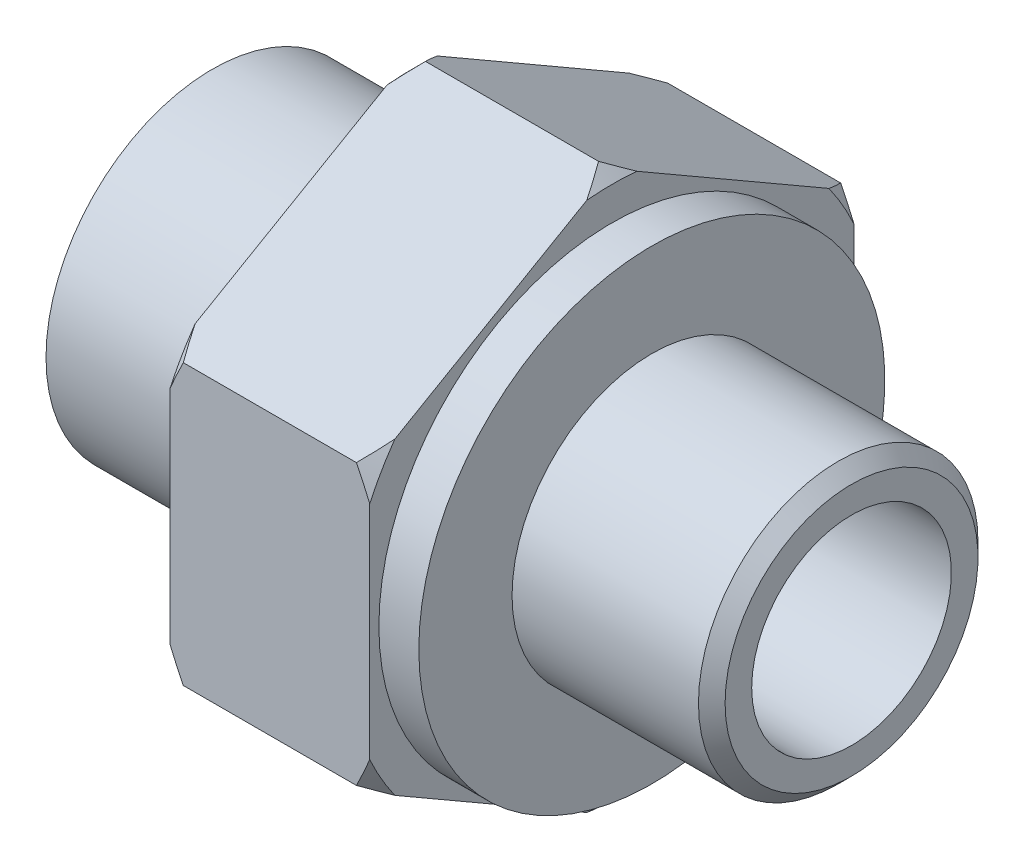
ISO-10303-21;
HEADER;
FILE_DESCRIPTION(('STEP AP214'),'2;1');
FILE_NAME('part.step','',(''),(''),'','','');
FILE_SCHEMA(('AUTOMOTIVE_DESIGN { 1 0 10303 214 1 1 1 1 }'));
ENDSEC;
DATA;
#1=APPLICATION_CONTEXT('core data for automotive mechanical design processes');
#2=APPLICATION_PROTOCOL_DEFINITION('international standard','automotive_design',2000,#1);
#3=PRODUCT_CONTEXT('',#1,'mechanical');
#4=PRODUCT('Part','Part','',(#3));
#5=PRODUCT_RELATED_PRODUCT_CATEGORY('part','',(#4));
#6=PRODUCT_DEFINITION_FORMATION('','',#4);
#7=PRODUCT_DEFINITION_CONTEXT('part definition',#1,'design');
#8=PRODUCT_DEFINITION('design','',#6,#7);
#9=PRODUCT_DEFINITION_SHAPE('','',#8);
#10=(LENGTH_UNIT() NAMED_UNIT(*) SI_UNIT(.MILLI.,.METRE.));
#11=(NAMED_UNIT(*) PLANE_ANGLE_UNIT() SI_UNIT($,.RADIAN.));
#12=(NAMED_UNIT(*) SI_UNIT($,.STERADIAN.) SOLID_ANGLE_UNIT());
#13=UNCERTAINTY_MEASURE_WITH_UNIT(LENGTH_MEASURE(1.E-05),#10,'distance_accuracy_value','');
#14=(GEOMETRIC_REPRESENTATION_CONTEXT(3) GLOBAL_UNCERTAINTY_ASSIGNED_CONTEXT((#13)) GLOBAL_UNIT_ASSIGNED_CONTEXT((#10,
#11,#12)) REPRESENTATION_CONTEXT('',''));
#15=CARTESIAN_POINT('',(0.,0.,0.));
#16=DIRECTION('',(0.,0.,1.));
#17=DIRECTION('',(1.,0.,0.));
#18=AXIS2_PLACEMENT_3D('',#15,#16,#17);
#19=CARTESIAN_POINT('',(25.5735568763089,17.5,0.));
#20=DIRECTION('',(-1.,0.,0.));
#21=DIRECTION('',(0.,0.,1.));
#22=AXIS2_PLACEMENT_3D('',#19,#20,#21);
#23=PLANE('',#22);
#24=CARTESIAN_POINT('',(25.5735568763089,0.,0.));
#25=DIRECTION('',(-1.,0.,0.));
#26=DIRECTION('',(0.,0.,1.));
#27=AXIS2_PLACEMENT_3D('',#24,#25,#26);
#28=CIRCLE('',#27,17.5);
#29=CARTESIAN_POINT('',(25.5735568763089,0.,17.5));
#30=VERTEX_POINT('',#29);
#31=EDGE_CURVE('E489',#30,#30,#28,.T.);
#32=ORIENTED_EDGE('',*,*,#31,.T.);
#33=EDGE_LOOP('',(#32));
#34=FACE_BOUND('',#33,.T.);
#35=DIRECTION('',(0.,0.499999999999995,-0.866025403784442));
#36=VECTOR('',#35,1.);
#37=CARTESIAN_POINT('',(25.5735568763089,20.125,1.51554445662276));
#38=LINE('',#37,#36);
#39=CARTESIAN_POINT('',(25.5735568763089,11.5891707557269,16.3000343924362));
#40=VERTEX_POINT('',#39);
#41=CARTESIAN_POINT('',(25.5735568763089,19.9108292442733,1.88649908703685));
#42=VERTEX_POINT('',#41);
#43=EDGE_CURVE('E284',#40,#42,#38,.T.);
#44=ORIENTED_EDGE('',*,*,#43,.F.);
#45=CARTESIAN_POINT('',(25.5735568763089,0.,0.));
#46=DIRECTION('',(-1.,0.,0.));
#47=DIRECTION('',(0.,0.,1.));
#48=AXIS2_PLACEMENT_3D('',#45,#46,#47);
#49=CIRCLE('',#48,20.);
#50=CARTESIAN_POINT('',(25.5735568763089,8.32165848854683,18.1865334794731));
#51=VERTEX_POINT('',#50);
#52=EDGE_CURVE('E203',#40,#51,#49,.F.);
#53=ORIENTED_EDGE('',*,*,#52,.T.);
#54=DIRECTION('',(0.,1.,0.));
#55=VECTOR('',#54,1.);
#56=CARTESIAN_POINT('',(25.5735568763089,17.5000000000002,18.186533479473));
#57=LINE('',#56,#55);
#58=CARTESIAN_POINT('',(25.5735568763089,-8.32165848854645,18.1865334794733));
#59=VERTEX_POINT('',#58);
#60=EDGE_CURVE('E283',#59,#51,#57,.T.);
#61=ORIENTED_EDGE('',*,*,#60,.F.);
#62=CARTESIAN_POINT('',(25.5735568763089,-11.5891707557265,16.3000343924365));
#63=VERTEX_POINT('',#62);
#64=EDGE_CURVE('E206',#59,#63,#49,.F.);
#65=ORIENTED_EDGE('',*,*,#64,.T.);
#66=DIRECTION('',(0.,0.500000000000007,0.866025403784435));
#67=VECTOR('',#66,1.);
#68=CARTESIAN_POINT('',(25.5735568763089,-11.3749999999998,16.6709890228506));
#69=LINE('',#68,#67);
#70=CARTESIAN_POINT('',(25.5735568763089,-19.9108292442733,1.88649908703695));
#71=VERTEX_POINT('',#70);
#72=EDGE_CURVE('E349',#71,#63,#69,.T.);
#73=ORIENTED_EDGE('',*,*,#72,.F.);
#74=CARTESIAN_POINT('',(25.5735568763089,-19.9108292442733,-1.8864990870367));
#75=VERTEX_POINT('',#74);
#76=EDGE_CURVE('E210',#71,#75,#49,.F.);
#77=ORIENTED_EDGE('',*,*,#76,.T.);
#78=DIRECTION('',(0.,-0.499999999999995,0.866025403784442));
#79=VECTOR('',#78,1.);
#80=CARTESIAN_POINT('',(25.5735568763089,-11.3750000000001,-16.6709890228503));
#81=LINE('',#80,#79);
#82=CARTESIAN_POINT('',(25.5735568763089,-11.5891707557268,-16.3000343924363));
#83=VERTEX_POINT('',#82);
#84=EDGE_CURVE('E359',#83,#75,#81,.T.);
#85=ORIENTED_EDGE('',*,*,#84,.F.);
#86=CARTESIAN_POINT('',(25.5735568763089,-8.3216584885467,-18.1865334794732));
#87=VERTEX_POINT('',#86);
#88=EDGE_CURVE('E334',#83,#87,#49,.F.);
#89=ORIENTED_EDGE('',*,*,#88,.T.);
#90=DIRECTION('',(0.,-1.,0.));
#91=VECTOR('',#90,1.);
#92=CARTESIAN_POINT('',(25.5735568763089,17.4999999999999,-18.1865334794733));
#93=LINE('',#92,#91);
#94=CARTESIAN_POINT('',(25.5735568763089,8.32165848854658,-18.1865334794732));
#95=VERTEX_POINT('',#94);
#96=EDGE_CURVE('E189',#95,#87,#93,.T.);
#97=ORIENTED_EDGE('',*,*,#96,.F.);
#98=CARTESIAN_POINT('',(25.5735568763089,11.5891707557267,-16.3000343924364));
#99=VERTEX_POINT('',#98);
#100=EDGE_CURVE('E333',#95,#99,#49,.F.);
#101=ORIENTED_EDGE('',*,*,#100,.T.);
#102=DIRECTION('',(0.,-0.500000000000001,-0.866025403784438));
#103=VECTOR('',#102,1.);
#104=CARTESIAN_POINT('',(25.5735568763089,20.125,-1.51554445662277));
#105=LINE('',#104,#103);
#106=CARTESIAN_POINT('',(25.5735568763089,19.9108292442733,-1.88649908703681));
#107=VERTEX_POINT('',#106);
#108=EDGE_CURVE('E239',#107,#99,#105,.T.);
#109=ORIENTED_EDGE('',*,*,#108,.F.);
#110=EDGE_CURVE('E326',#107,#42,#49,.F.);
#111=ORIENTED_EDGE('',*,*,#110,.T.);
#112=EDGE_LOOP('',(#44,#53,#61,#65,#73,#77,#85,#89,#97,#101,#109,#111));
#113=FACE_BOUND('',#112,.T.);
#114=ADVANCED_FACE('F40',(#34,#113),#23,.F.);
#115=CARTESIAN_POINT('',(10.5735568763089,21.,0.));
#116=DIRECTION('',(1.,0.,0.));
#117=DIRECTION('',(0.,0.,-1.));
#118=AXIS2_PLACEMENT_3D('',#115,#116,#117);
#119=PLANE('',#118);
#120=CARTESIAN_POINT('',(10.5735568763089,0.,0.));
#121=DIRECTION('',(-1.,0.,0.));
#122=DIRECTION('',(0.,0.,1.));
#123=AXIS2_PLACEMENT_3D('',#120,#121,#122);
#124=CIRCLE('',#123,12.5);
#125=CARTESIAN_POINT('',(10.5735568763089,0.,12.5));
#126=VERTEX_POINT('',#125);
#127=EDGE_CURVE('E491',#126,#126,#124,.T.);
#128=ORIENTED_EDGE('',*,*,#127,.F.);
#129=EDGE_LOOP('',(#128));
#130=FACE_BOUND('',#129,.T.);
#131=DIRECTION('',(0.,0.499999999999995,-0.866025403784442));
#132=VECTOR('',#131,1.);
#133=CARTESIAN_POINT('',(10.5735568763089,10.5000000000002,18.1865334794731));
#134=LINE('',#133,#132);
#135=CARTESIAN_POINT('',(10.5735568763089,11.5891707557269,16.3000343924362));
#136=VERTEX_POINT('',#135);
#137=CARTESIAN_POINT('',(10.5735568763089,19.9108292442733,1.88649908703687));
#138=VERTEX_POINT('',#137);
#139=EDGE_CURVE('E181',#136,#138,#134,.T.);
#140=ORIENTED_EDGE('',*,*,#139,.T.);
#141=CARTESIAN_POINT('',(10.5735568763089,0.,0.));
#142=DIRECTION('',(1.,0.,0.));
#143=DIRECTION('',(0.,0.,-1.));
#144=AXIS2_PLACEMENT_3D('',#141,#142,#143);
#145=CIRCLE('',#144,20.);
#146=CARTESIAN_POINT('',(10.5735568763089,19.9108292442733,-1.88649908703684));
#147=VERTEX_POINT('',#146);
#148=EDGE_CURVE('E187',#138,#147,#145,.F.);
#149=ORIENTED_EDGE('',*,*,#148,.T.);
#150=DIRECTION('',(0.,-0.500000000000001,-0.866025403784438));
#151=VECTOR('',#150,1.);
#152=CARTESIAN_POINT('',(10.5735568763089,21.,0.));
#153=LINE('',#152,#151);
#154=CARTESIAN_POINT('',(10.5735568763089,11.5891707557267,-16.3000343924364));
#155=VERTEX_POINT('',#154);
#156=EDGE_CURVE('E170',#147,#155,#153,.T.);
#157=ORIENTED_EDGE('',*,*,#156,.T.);
#158=CARTESIAN_POINT('',(10.5735568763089,8.32165848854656,-18.1865334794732));
#159=VERTEX_POINT('',#158);
#160=EDGE_CURVE('E195',#155,#159,#145,.F.);
#161=ORIENTED_EDGE('',*,*,#160,.T.);
#162=DIRECTION('',(0.,-1.,0.));
#163=VECTOR('',#162,1.);
#164=CARTESIAN_POINT('',(10.5735568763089,10.5,-18.1865334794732));
#165=LINE('',#164,#163);
#166=CARTESIAN_POINT('',(10.5735568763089,-8.32165848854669,-18.1865334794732));
#167=VERTEX_POINT('',#166);
#168=EDGE_CURVE('E180',#159,#167,#165,.T.);
#169=ORIENTED_EDGE('',*,*,#168,.T.);
#170=CARTESIAN_POINT('',(10.5735568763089,-11.5891707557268,-16.3000343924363));
#171=VERTEX_POINT('',#170);
#172=EDGE_CURVE('E199',#167,#171,#145,.F.);
#173=ORIENTED_EDGE('',*,*,#172,.T.);
#174=DIRECTION('',(0.,-0.499999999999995,0.866025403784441));
#175=VECTOR('',#174,1.);
#176=CARTESIAN_POINT('',(10.5735568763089,-10.5000000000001,-18.1865334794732));
#177=LINE('',#176,#175);
#178=CARTESIAN_POINT('',(10.5735568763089,-19.9108292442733,-1.88649908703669));
#179=VERTEX_POINT('',#178);
#180=EDGE_CURVE('E387',#171,#179,#177,.T.);
#181=ORIENTED_EDGE('',*,*,#180,.T.);
#182=CARTESIAN_POINT('',(10.5735568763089,-19.9108292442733,1.88649908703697));
#183=VERTEX_POINT('',#182);
#184=EDGE_CURVE('E204',#179,#183,#145,.F.);
#185=ORIENTED_EDGE('',*,*,#184,.T.);
#186=DIRECTION('',(0.,0.500000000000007,0.866025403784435));
#187=VECTOR('',#186,1.);
#188=CARTESIAN_POINT('',(10.5735568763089,-21.,1.46642301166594E-13));
#189=LINE('',#188,#187);
#190=CARTESIAN_POINT('',(10.5735568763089,-11.5891707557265,16.3000343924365));
#191=VERTEX_POINT('',#190);
#192=EDGE_CURVE('E382',#183,#191,#189,.T.);
#193=ORIENTED_EDGE('',*,*,#192,.T.);
#194=CARTESIAN_POINT('',(10.5735568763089,-8.32165848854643,18.1865334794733));
#195=VERTEX_POINT('',#194);
#196=EDGE_CURVE('E197',#191,#195,#145,.F.);
#197=ORIENTED_EDGE('',*,*,#196,.T.);
#198=DIRECTION('',(0.,1.,0.));
#199=VECTOR('',#198,1.);
#200=CARTESIAN_POINT('',(10.5735568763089,-10.4999999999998,18.1865334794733));
#201=LINE('',#200,#199);
#202=CARTESIAN_POINT('',(10.5735568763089,8.32165848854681,18.1865334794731));
#203=VERTEX_POINT('',#202);
#204=EDGE_CURVE('E377',#195,#203,#201,.T.);
#205=ORIENTED_EDGE('',*,*,#204,.T.);
#206=EDGE_CURVE('E194',#203,#136,#145,.F.);
#207=ORIENTED_EDGE('',*,*,#206,.T.);
#208=EDGE_LOOP('',(#140,#149,#157,#161,#169,#173,#181,#185,#193,#197,#205,#207));
#209=FACE_BOUND('',#208,.T.);
#210=ADVANCED_FACE('F192',(#130,#209),#119,.F.);
#211=CARTESIAN_POINT('',(10.5735568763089,0.,0.));
#212=DIRECTION('',(1.,0.,0.));
#213=DIRECTION('',(0.,0.,-1.));
#214=AXIS2_PLACEMENT_3D('',#211,#212,#213);
#215=CONICAL_SURFACE('',#214,20.,0.785398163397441);
#216=CARTESIAN_POINT('',(19.9849335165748,-23.114477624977,18.1865334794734));
#217=CARTESIAN_POINT('',(19.7804770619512,-22.8543191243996,18.1865334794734));
#218=CARTESIAN_POINT('',(19.5768330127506,-22.5935226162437,18.1865334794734));
#219=CARTESIAN_POINT('',(19.1713173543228,-22.0705504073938,18.1865334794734));
#220=CARTESIAN_POINT('',(18.969445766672,-21.8083746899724,18.1865334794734));
#221=CARTESIAN_POINT('',(18.3666547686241,-21.0195499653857,18.1865334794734));
#222=CARTESIAN_POINT('',(17.9686241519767,-20.4906859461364,18.1865334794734));
#223=CARTESIAN_POINT('',(17.1797221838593,-19.4233858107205,18.1865334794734));
#224=CARTESIAN_POINT('',(16.7888986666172,-18.8849142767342,18.1865334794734));
#225=CARTESIAN_POINT('',(16.0184891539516,-17.8000133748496,18.1865334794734));
#226=CARTESIAN_POINT('',(15.6389025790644,-17.2535844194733,18.1865334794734));
#227=CARTESIAN_POINT('',(14.8747057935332,-16.1238213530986,18.1865334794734));
#228=CARTESIAN_POINT('',(14.490797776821,-15.5400104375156,18.1865334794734));
#229=CARTESIAN_POINT('',(13.7416860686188,-14.3603587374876,18.1865334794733));
#230=CARTESIAN_POINT('',(13.3764845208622,-13.7645165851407,18.1865334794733));
#231=CARTESIAN_POINT('',(12.6703818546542,-12.5601445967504,18.1865334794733));
#232=CARTESIAN_POINT('',(12.3294329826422,-11.9516429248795,18.1865334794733));
#233=CARTESIAN_POINT('',(11.6773998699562,-10.7189442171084,18.1865334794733));
#234=CARTESIAN_POINT('',(11.3663062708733,-10.0947521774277,18.1865334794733));
#235=CARTESIAN_POINT('',(10.8127497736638,-8.89534608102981,18.1865334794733));
#236=CARTESIAN_POINT('',(10.5665097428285,-8.32188927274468,18.1865334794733));
#237=CARTESIAN_POINT('',(10.1114989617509,-7.16008914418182,18.1865334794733));
#238=CARTESIAN_POINT('',(9.90273182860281,-6.57174439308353,18.1865334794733));
#239=CARTESIAN_POINT('',(9.5330620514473,-5.38748152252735,18.1865334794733));
#240=CARTESIAN_POINT('',(9.37162628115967,-4.79173339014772,18.1865334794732));
#241=CARTESIAN_POINT('',(9.16900405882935,-3.8893155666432,18.1865334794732));
#242=CARTESIAN_POINT('',(9.10804778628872,-3.58701312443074,18.1865334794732));
#243=CARTESIAN_POINT('',(9.00018993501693,-2.97992566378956,18.1865334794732));
#244=CARTESIAN_POINT('',(8.95328650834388,-2.67514097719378,18.1865334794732));
#245=CARTESIAN_POINT('',(8.8735614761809,-2.05803284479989,18.1865334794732));
#246=CARTESIAN_POINT('',(8.84101447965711,-1.74567378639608,18.1865334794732));
#247=CARTESIAN_POINT('',(8.79185475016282,-1.11969752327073,18.1865334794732));
#248=CARTESIAN_POINT('',(8.77524199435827,-0.806080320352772,18.1865334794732));
#249=CARTESIAN_POINT('',(8.75826002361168,-0.178425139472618,18.1865334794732));
#250=CARTESIAN_POINT('',(8.75788972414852,0.135612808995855,18.1865334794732));
#251=CARTESIAN_POINT('',(8.77339667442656,0.763286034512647,18.1865334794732));
#252=CARTESIAN_POINT('',(8.78927397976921,1.07692131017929,18.1865334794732));
#253=CARTESIAN_POINT('',(8.83705901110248,1.70398452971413,18.1865334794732));
#254=CARTESIAN_POINT('',(8.86901849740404,2.01740851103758,18.1865334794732));
#255=CARTESIAN_POINT('',(8.948419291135,2.64227655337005,18.1865334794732));
#256=CARTESIAN_POINT('',(8.99586056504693,2.95372061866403,18.1865334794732));
#257=CARTESIAN_POINT('',(9.1054373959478,3.57404550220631,18.1865334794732));
#258=CARTESIAN_POINT('',(9.16757468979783,3.88292601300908,18.1865334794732));
#259=CARTESIAN_POINT('',(9.30558362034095,4.4976230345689,18.1865334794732));
#260=CARTESIAN_POINT('',(9.38145780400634,4.80343896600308,18.1865334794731));
#261=CARTESIAN_POINT('',(9.68134021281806,5.91248611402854,18.1865334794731));
#262=CARTESIAN_POINT('',(9.94355746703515,6.70564802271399,18.1865334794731));
#263=CARTESIAN_POINT('',(10.3885991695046,7.87504369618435,18.1865334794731));
#264=CARTESIAN_POINT('',(10.5456413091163,8.26160659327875,18.1865334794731));
#265=CARTESIAN_POINT('',(10.874800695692,9.02830284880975,18.1865334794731));
#266=CARTESIAN_POINT('',(11.046917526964,9.4084363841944,18.1865334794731));
#267=CARTESIAN_POINT('',(11.4054391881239,10.1650942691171,18.1865334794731));
#268=CARTESIAN_POINT('',(11.5919349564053,10.541575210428,18.1865334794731));
#269=CARTESIAN_POINT('',(11.9763768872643,11.2886343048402,18.1865334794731));
#270=CARTESIAN_POINT('',(12.1743231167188,11.6592124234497,18.1865334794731));
#271=CARTESIAN_POINT('',(12.5800627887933,12.3947723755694,18.1865334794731));
#272=CARTESIAN_POINT('',(12.7878531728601,12.7597559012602,18.1865334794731));
#273=CARTESIAN_POINT('',(13.2120333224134,13.4846953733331,18.1865334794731));
#274=CARTESIAN_POINT('',(13.4284233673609,13.8446511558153,18.1865334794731));
#275=CARTESIAN_POINT('',(13.8900583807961,14.594687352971,18.186533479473));
#276=CARTESIAN_POINT('',(14.1360647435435,14.9842984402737,18.186533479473));
#277=CARTESIAN_POINT('',(14.6358335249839,15.7585072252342,18.186533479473));
#278=CARTESIAN_POINT('',(14.8895960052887,16.1431048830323,18.186533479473));
#279=CARTESIAN_POINT('',(15.4038781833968,16.9078367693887,18.186533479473));
#280=CARTESIAN_POINT('',(15.6643989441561,17.2879702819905,18.186533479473));
#281=CARTESIAN_POINT('',(16.1912895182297,18.0441616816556,18.186533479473));
#282=CARTESIAN_POINT('',(16.4576593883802,18.4202195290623,18.186533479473));
#283=CARTESIAN_POINT('',(16.9898351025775,19.160757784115,18.186533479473));
#284=CARTESIAN_POINT('',(17.25553417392,19.5253150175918,18.186533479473));
#285=CARTESIAN_POINT('',(17.7912515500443,20.251243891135,18.186533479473));
#286=CARTESIAN_POINT('',(18.06126989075,20.6126155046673,18.186533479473));
#287=CARTESIAN_POINT('',(18.6049538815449,21.3322480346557,18.186533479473));
#288=CARTESIAN_POINT('',(18.8786171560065,21.6905107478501,18.186533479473));
#289=CARTESIAN_POINT('',(19.4293336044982,22.4044015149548,18.186533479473));
#290=CARTESIAN_POINT('',(19.7063866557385,22.7600296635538,18.186533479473));
#291=CARTESIAN_POINT('',(19.9849335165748,23.1144776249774,18.186533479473));
#292=B_SPLINE_CURVE_WITH_KNOTS('',3,(#216,#217,#218,#219,#220,#221,#222,#223,#224,#225,#226,
#227,#228,#229,#230,#231,#232,#233,#234,#235,#236,#237,#238,#239,#240,#241,#242,#243,#244,#245,
#246,#247,#248,#249,#250,#251,#252,#253,#254,#255,#256,#257,#258,#259,#260,#261,#262,#263,#264,
#265,#266,#267,#268,#269,#270,#271,#272,#273,#274,#275,#276,#277,#278,#279,#280,#281,#282,#283,
#284,#285,#286,#287,#288,#289,#290,#291),.UNSPECIFIED.,.F.,.F.,(4,2,2,2,2,2,2,2,2,2,2,2,2,2,2,2,
2,2,2,2,2,2,2,2,2,2,2,2,2,2,2,2,2,2,2,2,2,4),(0.,0.992652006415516,1.9853160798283,
3.97095948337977,5.96690068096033,7.9627387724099,10.0586355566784,12.1547719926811,
14.246659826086,16.3378897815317,18.2090773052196,20.0804453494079,21.929844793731,
22.8547288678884,23.7794912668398,24.7212472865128,25.6630019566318,26.6046937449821,
27.5463887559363,28.4911341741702,29.4358775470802,30.3807326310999,31.3257630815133,
33.8268012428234,35.0783551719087,36.3298745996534,37.590086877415,38.8503065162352,
40.1101371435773,41.3700087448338,42.7522334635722,44.1344691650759,45.5169236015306,
46.8993914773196,48.2526785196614,49.6059768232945,50.9584325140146,52.3108393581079),.UNSPECIFIED.);
#293=CARTESIAN_POINT('',(11.5735568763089,10.5000000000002,18.1865334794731));
#294=VERTEX_POINT('',#293);
#295=EDGE_CURVE('E276',#203,#294,#292,.T.);
#296=ORIENTED_EDGE('',*,*,#295,.T.);
#297=CARTESIAN_POINT('',(21.5421143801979,3.2170279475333,30.8010111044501));
#298=CARTESIAN_POINT('',(21.1381064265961,3.46663050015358,30.3686868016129));
#299=CARTESIAN_POINT('',(20.7365479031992,3.71723345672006,29.9346297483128));
#300=CARTESIAN_POINT('',(19.9392742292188,4.22078911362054,29.0624457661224));
#301=CARTESIAN_POINT('',(19.5435596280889,4.47374203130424,28.6243184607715));
#302=CARTESIAN_POINT('',(18.7580247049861,4.98292843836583,27.7423817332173));
#303=CARTESIAN_POINT('',(18.3682213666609,5.23916849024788,27.2985609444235));
#304=CARTESIAN_POINT('',(17.5968118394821,5.75470868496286,26.4056191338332));
#305=CARTESIAN_POINT('',(17.2152054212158,6.01400874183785,25.9564982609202));
#306=CARTESIAN_POINT('',(16.4511339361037,6.54351805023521,25.0393612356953));
#307=CARTESIAN_POINT('',(16.0689489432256,6.81382858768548,24.5711696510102));
#308=CARTESIAN_POINT('',(15.3171028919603,7.35880216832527,23.6272477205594));
#309=CARTESIAN_POINT('',(14.9474424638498,7.63346542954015,23.1515169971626));
#310=CARTESIAN_POINT('',(14.2238290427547,8.18756993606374,22.1917798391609));
#311=CARTESIAN_POINT('',(13.8698616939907,8.46700647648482,21.7077815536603));
#312=CARTESIAN_POINT('',(13.180950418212,9.03165855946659,20.7297754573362));
#313=CARTESIAN_POINT('',(12.8460039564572,9.31687332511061,20.2357689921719));
#314=CARTESIAN_POINT('',(12.1954061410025,9.89787845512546,19.229438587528));
#315=CARTESIAN_POINT('',(11.880077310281,10.1937597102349,18.7169572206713));
#316=CARTESIAN_POINT('',(11.2799889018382,10.7932938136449,17.6785336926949));
#317=CARTESIAN_POINT('',(10.9952336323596,11.0969477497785,17.1525896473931));
#318=CARTESIAN_POINT('',(10.465778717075,11.7109519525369,16.0891031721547));
#319=CARTESIAN_POINT('',(10.220865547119,12.0212557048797,15.5516413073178));
#320=CARTESIAN_POINT('',(9.77868122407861,12.650282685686,14.4621346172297));
#321=CARTESIAN_POINT('',(9.58139598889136,12.9690033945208,13.9100941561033));
#322=CARTESIAN_POINT('',(9.27674469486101,13.552652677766,12.8991839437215));
#323=CARTESIAN_POINT('',(9.15941094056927,13.8162730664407,12.4425800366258));
#324=CARTESIAN_POINT('',(8.96774946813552,14.3474171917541,11.5226114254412));
#325=CARTESIAN_POINT('',(8.89341549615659,14.6149403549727,11.0592477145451));
#326=CARTESIAN_POINT('',(8.79158069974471,15.1517928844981,10.1293918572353));
#327=CARTESIAN_POINT('',(8.76400288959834,15.4211185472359,9.66290612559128));
#328=CARTESIAN_POINT('',(8.75695576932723,15.9599347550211,8.72964907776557));
#329=CARTESIAN_POINT('',(8.77748721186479,16.2294253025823,8.26287775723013));
#330=CARTESIAN_POINT('',(8.86539536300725,16.7656619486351,7.33408864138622));
#331=CARTESIAN_POINT('',(8.93263439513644,17.0324137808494,6.87206091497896));
#332=CARTESIAN_POINT('',(9.11038660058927,17.5622579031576,5.95434397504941));
#333=CARTESIAN_POINT('',(9.22090330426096,17.8253498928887,5.49865528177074));
#334=CARTESIAN_POINT('',(9.48072155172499,18.3474786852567,4.59430168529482));
#335=CARTESIAN_POINT('',(9.63013797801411,18.6065010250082,4.14566183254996));
#336=CARTESIAN_POINT('',(9.96215857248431,19.119092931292,3.2578266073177));
#337=CARTESIAN_POINT('',(10.1447609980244,19.3726627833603,2.81863074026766));
#338=CARTESIAN_POINT('',(10.6121117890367,19.968949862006,1.78583122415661));
#339=CARTESIAN_POINT('',(10.9094036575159,20.3092003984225,1.19650000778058));
#340=CARTESIAN_POINT('',(11.545262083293,20.9800009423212,0.0346393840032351));
#341=CARTESIAN_POINT('',(11.8838520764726,21.3105453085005,-0.537880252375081));
#342=CARTESIAN_POINT('',(12.5936373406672,21.9635943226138,-1.66899432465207));
#343=CARTESIAN_POINT('',(12.9648995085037,22.2860806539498,-2.22755703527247));
#344=CARTESIAN_POINT('',(13.7322412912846,22.9234503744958,-3.33151377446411));
#345=CARTESIAN_POINT('',(14.1283162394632,23.2383351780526,-3.87691025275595));
#346=CARTESIAN_POINT('',(14.9418292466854,23.8630828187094,-4.95900490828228));
#347=CARTESIAN_POINT('',(15.3593540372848,24.1729172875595,-5.49565395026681));
#348=CARTESIAN_POINT('',(16.2101210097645,24.7871408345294,-6.55952034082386));
#349=CARTESIAN_POINT('',(16.643363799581,25.0915297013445,-7.08673732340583));
#350=CARTESIAN_POINT('',(17.5220381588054,25.6953757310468,-8.13262932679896));
#351=CARTESIAN_POINT('',(17.9674564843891,25.9948377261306,-8.65131271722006));
#352=CARTESIAN_POINT('',(18.8685768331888,26.5898472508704,-9.68189944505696));
#353=CARTESIAN_POINT('',(19.3242785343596,26.8853949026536,-10.193802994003));
#354=CARTESIAN_POINT('',(19.9294105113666,27.2720379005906,-10.8634883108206));
#355=CARTESIAN_POINT('',(20.0750178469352,27.3646356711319,-11.0238723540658));
#356=CARTESIAN_POINT('',(20.367042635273,27.5495198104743,-11.3441010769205));
#357=CARTESIAN_POINT('',(20.513460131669,27.6418061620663,-11.503945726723));
#358=CARTESIAN_POINT('',(20.8065124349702,27.8257392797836,-11.822527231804));
#359=CARTESIAN_POINT('',(20.9531444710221,27.9173871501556,-11.9812659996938));
#360=CARTESIAN_POINT('',(21.2471108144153,28.100392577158,-12.2982406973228));
#361=CARTESIAN_POINT('',(21.3944450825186,28.1917501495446,-12.4564766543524));
#362=CARTESIAN_POINT('',(21.5421143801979,28.2829720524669,-12.6144776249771));
#363=B_SPLINE_CURVE_WITH_KNOTS('',3,(#297,#298,#299,#300,#301,#302,#303,#304,#305,#306,#307,
#308,#309,#310,#311,#312,#313,#314,#315,#316,#317,#318,#319,#320,#321,#322,#323,#324,#325,#326,
#327,#328,#329,#330,#331,#332,#333,#334,#335,#336,#337,#338,#339,#340,#341,#342,#343,#344,#345,
#346,#347,#348,#349,#350,#351,#352,#353,#354,#355,#356,#357,#358,#359,#360,#361,#362),
.UNSPECIFIED.,.F.,.F.,(4,2,2,2,2,2,2,2,2,2,2,2,2,2,2,2,2,2,2,2,2,2,2,2,2,2,2,2,2,2,2,2,4),(0.,
1.92663068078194,3.85344136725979,5.78501386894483,7.71653223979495,9.70259594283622,
11.6887594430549,13.6730668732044,15.65710924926,17.6680058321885,19.6791854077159,
21.6792036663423,23.6786298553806,25.2974868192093,26.916108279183,28.5320620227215,
30.1480410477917,31.7592768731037,33.3706441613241,34.986825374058,36.6029217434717,
38.8288500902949,41.0560475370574,43.2879163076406,45.5193665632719,47.760685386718,
50.0020909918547,52.2411486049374,54.4801361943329,55.1868813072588,55.8936648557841,
56.5978538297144,57.3020039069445),.UNSPECIFIED.);
#364=EDGE_CURVE('E493',#294,#136,#363,.T.);
#365=ORIENTED_EDGE('',*,*,#364,.T.);
#366=ORIENTED_EDGE('',*,*,#206,.F.);
#367=EDGE_LOOP('',(#296,#365,#366));
#368=FACE_BOUND('',#367,.T.);
#369=ADVANCED_FACE('F242',(#368),#215,.T.);
#370=CARTESIAN_POINT('',(21.5421143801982,-28.2829720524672,-12.6144776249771));
#371=CARTESIAN_POINT('',(21.1381064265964,-28.033369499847,-12.1821533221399));
#372=CARTESIAN_POINT('',(20.7365479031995,-27.7827665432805,-11.7480962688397));
#373=CARTESIAN_POINT('',(19.9392742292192,-27.27921088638,-10.8759122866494));
#374=CARTESIAN_POINT('',(19.5435596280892,-27.0262579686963,-10.4377849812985));
#375=CARTESIAN_POINT('',(18.7580247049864,-26.5170715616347,-9.55584825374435));
#376=CARTESIAN_POINT('',(18.3682213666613,-26.2608315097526,-9.11202746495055));
#377=CARTESIAN_POINT('',(17.5968118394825,-25.7452913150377,-8.21908565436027));
#378=CARTESIAN_POINT('',(17.2152054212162,-25.4859912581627,-7.7699647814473));
#379=CARTESIAN_POINT('',(16.4511339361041,-24.9564819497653,-6.85282775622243));
#380=CARTESIAN_POINT('',(16.068948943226,-24.686171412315,-6.38463617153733));
#381=CARTESIAN_POINT('',(15.3171028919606,-24.1411978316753,-5.44071424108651));
#382=CARTESIAN_POINT('',(14.9474424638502,-23.8665345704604,-4.96498351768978));
#383=CARTESIAN_POINT('',(14.2238290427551,-23.3124300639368,-4.00524635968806));
#384=CARTESIAN_POINT('',(13.8698616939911,-23.0329935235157,-3.52124807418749));
#385=CARTESIAN_POINT('',(13.1809504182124,-22.468341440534,-2.54324197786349));
#386=CARTESIAN_POINT('',(12.8460039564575,-22.1831266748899,-2.04923551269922));
#387=CARTESIAN_POINT('',(12.1954061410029,-21.6021215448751,-1.04290510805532));
#388=CARTESIAN_POINT('',(11.8800773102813,-21.3062402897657,-0.530423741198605));
#389=CARTESIAN_POINT('',(11.2799889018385,-20.7067061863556,0.507999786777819));
#390=CARTESIAN_POINT('',(10.9952336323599,-20.4030522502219,1.03394383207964));
#391=CARTESIAN_POINT('',(10.4657787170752,-19.7890480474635,2.09743030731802));
#392=CARTESIAN_POINT('',(10.2208655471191,-19.4787442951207,2.63489217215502));
#393=CARTESIAN_POINT('',(9.77868122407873,-18.8497173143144,3.72439886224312));
#394=CARTESIAN_POINT('',(9.58139598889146,-18.5309966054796,4.27643932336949));
#395=CARTESIAN_POINT('',(9.27674469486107,-17.9473473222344,5.28734953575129));
#396=CARTESIAN_POINT('',(9.15941094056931,-17.6837269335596,5.74395344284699));
#397=CARTESIAN_POINT('',(8.96774946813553,-17.1525828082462,6.66392205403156));
#398=CARTESIAN_POINT('',(8.89341549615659,-16.8850596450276,7.12728576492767));
#399=CARTESIAN_POINT('',(8.79158069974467,-16.3482071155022,8.05714162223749));
#400=CARTESIAN_POINT('',(8.7640028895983,-16.0788814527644,8.52362735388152));
#401=CARTESIAN_POINT('',(8.75695576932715,-15.5400652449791,9.45688440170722));
#402=CARTESIAN_POINT('',(8.77748721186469,-15.270574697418,9.92365572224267));
#403=CARTESIAN_POINT('',(8.86539536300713,-14.7343380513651,10.8524448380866));
#404=CARTESIAN_POINT('',(8.93263439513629,-14.4675862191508,11.3144725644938));
#405=CARTESIAN_POINT('',(9.1103866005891,-13.9377420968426,12.2321895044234));
#406=CARTESIAN_POINT('',(9.22090330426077,-13.6746501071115,12.6878781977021));
#407=CARTESIAN_POINT('',(9.48072155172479,-13.1525213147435,13.592231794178));
#408=CARTESIAN_POINT('',(9.6301379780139,-12.893498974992,14.0408716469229));
#409=CARTESIAN_POINT('',(9.96215857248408,-12.3809070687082,14.9287068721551));
#410=CARTESIAN_POINT('',(10.1447609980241,-12.1273372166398,15.3679027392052));
#411=CARTESIAN_POINT('',(10.6121117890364,-11.5310501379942,16.4007022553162));
#412=CARTESIAN_POINT('',(10.9094036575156,-11.1907996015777,16.9900334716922));
#413=CARTESIAN_POINT('',(11.5452620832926,-10.519999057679,18.1518940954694));
#414=CARTESIAN_POINT('',(11.8838520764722,-10.1894546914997,18.7244137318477));
#415=CARTESIAN_POINT('',(12.5936373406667,-9.53640567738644,19.8555278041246));
#416=CARTESIAN_POINT('',(12.9648995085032,-9.21391934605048,20.4140905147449));
#417=CARTESIAN_POINT('',(13.732241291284,-8.57654962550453,21.5180472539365));
#418=CARTESIAN_POINT('',(14.1283162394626,-8.26166482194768,22.0634437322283));
#419=CARTESIAN_POINT('',(14.9418292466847,-7.63691718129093,23.1455383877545));
#420=CARTESIAN_POINT('',(15.359354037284,-7.32708271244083,23.682187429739));
#421=CARTESIAN_POINT('',(16.2101210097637,-6.71285916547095,24.746053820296));
#422=CARTESIAN_POINT('',(16.6433637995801,-6.40847029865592,25.2732708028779));
#423=CARTESIAN_POINT('',(17.5220381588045,-5.80462426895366,26.319162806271));
#424=CARTESIAN_POINT('',(17.9674564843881,-5.50516227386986,26.837846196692));
#425=CARTESIAN_POINT('',(18.8685768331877,-4.91015274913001,27.8684329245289));
#426=CARTESIAN_POINT('',(19.3242785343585,-4.61460509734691,28.3803364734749));
#427=CARTESIAN_POINT('',(19.9294105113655,-4.22796209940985,29.0500217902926));
#428=CARTESIAN_POINT('',(20.0750178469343,-4.13536432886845,29.2104058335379));
#429=CARTESIAN_POINT('',(20.3670426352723,-3.95048018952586,29.5306345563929));
#430=CARTESIAN_POINT('',(20.5134601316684,-3.85819383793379,29.6904792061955));
#431=CARTESIAN_POINT('',(20.8065124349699,-3.67426072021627,30.0090607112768));
#432=CARTESIAN_POINT('',(20.9531444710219,-3.58261284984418,30.1677994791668));
#433=CARTESIAN_POINT('',(21.2471108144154,-3.39960742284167,30.4847741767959));
#434=CARTESIAN_POINT('',(21.3944450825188,-3.30824985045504,30.6430101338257));
#435=CARTESIAN_POINT('',(21.5421143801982,-3.2170279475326,30.8010111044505));
#436=B_SPLINE_CURVE_WITH_KNOTS('',3,(#370,#371,#372,#373,#374,#375,#376,#377,#378,#379,#380,
#381,#382,#383,#384,#385,#386,#387,#388,#389,#390,#391,#392,#393,#394,#395,#396,#397,#398,#399,
#400,#401,#402,#403,#404,#405,#406,#407,#408,#409,#410,#411,#412,#413,#414,#415,#416,#417,#418,
#419,#420,#421,#422,#423,#424,#425,#426,#427,#428,#429,#430,#431,#432,#433,#434,#435),
.UNSPECIFIED.,.F.,.F.,(4,2,2,2,2,2,2,2,2,2,2,2,2,2,2,2,2,2,2,2,2,2,2,2,2,2,2,2,2,2,2,2,4),(0.,
1.9266306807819,3.85344136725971,5.78501386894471,7.71653223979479,9.70259594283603,
11.6887594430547,13.6730668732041,15.6571092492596,17.6680058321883,19.6791854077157,
21.6792036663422,23.6786298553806,25.2974868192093,26.916108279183,28.5320620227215,
30.1480410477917,31.7592768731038,33.3706441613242,34.986825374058,36.6029217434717,
38.8288500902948,41.0560475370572,43.2879163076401,45.5193665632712,47.7606853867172,
50.0020909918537,52.2411486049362,54.4801361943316,55.1868813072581,55.8936648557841,
56.5978538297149,57.3020039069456),.UNSPECIFIED.);
#437=CARTESIAN_POINT('',(11.5735568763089,-10.4999999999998,18.1865334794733));
#438=VERTEX_POINT('',#437);
#439=EDGE_CURVE('E269',#191,#438,#436,.T.);
#440=ORIENTED_EDGE('',*,*,#439,.T.);
#441=EDGE_CURVE('E282',#438,#195,#292,.T.);
#442=ORIENTED_EDGE('',*,*,#441,.T.);
#443=ORIENTED_EDGE('',*,*,#196,.F.);
#444=EDGE_LOOP('',(#440,#442,#443));
#445=FACE_BOUND('',#444,.T.);
#446=ADVANCED_FACE('F246',(#445),#215,.T.);
#447=CARTESIAN_POINT('',(21.5421143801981,-3.21702794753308,-30.8010111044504));
#448=CARTESIAN_POINT('',(21.1381064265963,-3.46663050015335,-30.3686868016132));
#449=CARTESIAN_POINT('',(20.7365479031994,-3.71723345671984,-29.934629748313));
#450=CARTESIAN_POINT('',(19.9392742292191,-4.22078911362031,-29.0624457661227));
#451=CARTESIAN_POINT('',(19.5435596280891,-4.473742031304,-28.6243184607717));
#452=CARTESIAN_POINT('',(18.7580247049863,-4.98292843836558,-27.7423817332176));
#453=CARTESIAN_POINT('',(18.3682213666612,-5.23916849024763,-27.2985609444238));
#454=CARTESIAN_POINT('',(17.5968118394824,-5.7547086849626,-26.4056191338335));
#455=CARTESIAN_POINT('',(17.2152054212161,-6.01400874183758,-25.9564982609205));
#456=CARTESIAN_POINT('',(16.451133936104,-6.54351805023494,-25.0393612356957));
#457=CARTESIAN_POINT('',(16.0689489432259,-6.8138285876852,-24.5711696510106));
#458=CARTESIAN_POINT('',(15.3171028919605,-7.35880216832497,-23.6272477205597));
#459=CARTESIAN_POINT('',(14.9474424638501,-7.63346542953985,-23.151516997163));
#460=CARTESIAN_POINT('',(14.223829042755,-8.18756993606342,-22.1917798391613));
#461=CARTESIAN_POINT('',(13.869861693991,-8.4670064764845,-21.7077815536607));
#462=CARTESIAN_POINT('',(13.1809504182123,-9.03165855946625,-20.7297754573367));
#463=CARTESIAN_POINT('',(12.8460039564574,-9.31687332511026,-20.2357689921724));
#464=CARTESIAN_POINT('',(12.1954061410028,-9.89787845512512,-19.2294385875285));
#465=CARTESIAN_POINT('',(11.8800773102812,-10.1937597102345,-18.7169572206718));
#466=CARTESIAN_POINT('',(11.2799889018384,-10.7932938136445,-17.6785336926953));
#467=CARTESIAN_POINT('',(10.9952336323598,-11.0969477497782,-17.1525896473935));
#468=CARTESIAN_POINT('',(10.4657787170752,-11.7109519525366,-16.0891031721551));
#469=CARTESIAN_POINT('',(10.2208655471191,-12.0212557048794,-15.5516413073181));
#470=CARTESIAN_POINT('',(9.77868122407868,-12.6502826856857,-14.46213461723));
#471=CARTESIAN_POINT('',(9.58139598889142,-12.9690033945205,-13.9100941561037));
#472=CARTESIAN_POINT('',(9.27674469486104,-13.5526526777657,-12.8991839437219));
#473=CARTESIAN_POINT('',(9.15941094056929,-13.8162730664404,-12.4425800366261));
#474=CARTESIAN_POINT('',(8.96774946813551,-14.3474171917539,-11.5226114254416));
#475=CARTESIAN_POINT('',(8.89341549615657,-14.6149403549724,-11.0592477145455));
#476=CARTESIAN_POINT('',(8.79158069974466,-15.1517928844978,-10.1293918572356));
#477=CARTESIAN_POINT('',(8.76400288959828,-15.4211185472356,-9.66290612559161));
#478=CARTESIAN_POINT('',(8.75695576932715,-15.9599347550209,-8.7296490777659));
#479=CARTESIAN_POINT('',(8.77748721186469,-16.229425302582,-8.26287775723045));
#480=CARTESIAN_POINT('',(8.86539536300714,-16.7656619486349,-7.33408864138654));
#481=CARTESIAN_POINT('',(8.93263439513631,-17.0324137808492,-6.87206091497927));
#482=CARTESIAN_POINT('',(9.11038660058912,-17.5622579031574,-5.95434397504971));
#483=CARTESIAN_POINT('',(9.22090330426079,-17.8253498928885,-5.49865528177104));
#484=CARTESIAN_POINT('',(9.48072155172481,-18.3474786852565,-4.59430168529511));
#485=CARTESIAN_POINT('',(9.63013797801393,-18.6065010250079,-4.14566183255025));
#486=CARTESIAN_POINT('',(9.96215857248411,-19.1190929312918,-3.25782660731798));
#487=CARTESIAN_POINT('',(10.1447609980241,-19.3726627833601,-2.81863074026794));
#488=CARTESIAN_POINT('',(10.6121117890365,-19.9689498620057,-1.78583122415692));
#489=CARTESIAN_POINT('',(10.9094036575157,-20.3092003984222,-1.19650000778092));
#490=CARTESIAN_POINT('',(11.5452620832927,-20.9800009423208,-0.0346393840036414));
#491=CARTESIAN_POINT('',(11.8838520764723,-21.3105453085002,0.537880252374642));
#492=CARTESIAN_POINT('',(12.5936373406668,-21.9635943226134,1.66899432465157));
#493=CARTESIAN_POINT('',(12.9648995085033,-22.2860806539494,2.22755703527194));
#494=CARTESIAN_POINT('',(13.7322412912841,-22.9234503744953,3.33151377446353));
#495=CARTESIAN_POINT('',(14.1283162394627,-23.2383351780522,3.87691025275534));
#496=CARTESIAN_POINT('',(14.9418292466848,-23.8630828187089,4.95900490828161));
#497=CARTESIAN_POINT('',(15.3593540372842,-24.172917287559,5.49565395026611));
#498=CARTESIAN_POINT('',(16.2101210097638,-24.7871408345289,6.5595203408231));
#499=CARTESIAN_POINT('',(16.6433637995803,-25.0915297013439,7.08673732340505));
#500=CARTESIAN_POINT('',(17.5220381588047,-25.6953757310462,8.13262932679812));
#501=CARTESIAN_POINT('',(17.9674564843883,-25.99483772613,8.6513127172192));
#502=CARTESIAN_POINT('',(18.8685768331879,-26.5898472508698,9.68189944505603));
#503=CARTESIAN_POINT('',(19.3242785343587,-26.8853949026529,10.1938029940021));
#504=CARTESIAN_POINT('',(19.9294105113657,-27.27203790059,10.8634883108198));
#505=CARTESIAN_POINT('',(20.0750178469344,-27.3646356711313,11.023872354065));
#506=CARTESIAN_POINT('',(20.3670426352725,-27.5495198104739,11.34410107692));
#507=CARTESIAN_POINT('',(20.5134601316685,-27.6418061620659,11.5039457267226));
#508=CARTESIAN_POINT('',(20.8065124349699,-27.8257392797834,11.8225272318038));
#509=CARTESIAN_POINT('',(20.9531444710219,-27.9173871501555,11.9812659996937));
#510=CARTESIAN_POINT('',(21.2471108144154,-28.100392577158,12.2982406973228));
#511=CARTESIAN_POINT('',(21.3944450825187,-28.1917501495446,12.4564766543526));
#512=CARTESIAN_POINT('',(21.5421143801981,-28.282972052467,12.6144776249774));
#513=B_SPLINE_CURVE_WITH_KNOTS('',3,(#447,#448,#449,#450,#451,#452,#453,#454,#455,#456,#457,
#458,#459,#460,#461,#462,#463,#464,#465,#466,#467,#468,#469,#470,#471,#472,#473,#474,#475,#476,
#477,#478,#479,#480,#481,#482,#483,#484,#485,#486,#487,#488,#489,#490,#491,#492,#493,#494,#495,
#496,#497,#498,#499,#500,#501,#502,#503,#504,#505,#506,#507,#508,#509,#510,#511,#512),
.UNSPECIFIED.,.F.,.F.,(4,2,2,2,2,2,2,2,2,2,2,2,2,2,2,2,2,2,2,2,2,2,2,2,2,2,2,2,2,2,2,2,4),(0.,
1.92663068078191,3.85344136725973,5.78501386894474,7.71653223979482,9.70259594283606,
11.6887594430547,13.6730668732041,15.6571092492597,17.6680058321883,19.6791854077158,
21.6792036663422,23.6786298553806,25.2974868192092,26.916108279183,28.5320620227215,
30.1480410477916,31.7592768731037,33.3706441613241,34.986825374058,36.6029217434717,
38.8288500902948,41.0560475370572,43.2879163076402,45.5193665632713,47.7606853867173,
50.0020909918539,52.2411486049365,54.4801361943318,55.1868813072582,55.893664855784,
56.5978538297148,57.3020039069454),.UNSPECIFIED.);
#514=CARTESIAN_POINT('',(11.5735568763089,-21.,1.46642301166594E-13));
#515=VERTEX_POINT('',#514);
#516=EDGE_CURVE('E263',#179,#515,#513,.T.);
#517=ORIENTED_EDGE('',*,*,#516,.T.);
#518=EDGE_CURVE('E397',#515,#183,#436,.T.);
#519=ORIENTED_EDGE('',*,*,#518,.T.);
#520=ORIENTED_EDGE('',*,*,#184,.F.);
#521=EDGE_LOOP('',(#517,#519,#520));
#522=FACE_BOUND('',#521,.T.);
#523=ADVANCED_FACE('F403',(#522),#215,.T.);
#524=CARTESIAN_POINT('',(19.9849335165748,23.1144776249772,-18.1865334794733));
#525=CARTESIAN_POINT('',(19.7804770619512,22.8543191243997,-18.1865334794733));
#526=CARTESIAN_POINT('',(19.5768330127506,22.5935226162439,-18.1865334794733));
#527=CARTESIAN_POINT('',(19.1713173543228,22.070550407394,-18.1865334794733));
#528=CARTESIAN_POINT('',(18.969445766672,21.8083746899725,-18.1865334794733));
#529=CARTESIAN_POINT('',(18.3666547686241,21.0195499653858,-18.1865334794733));
#530=CARTESIAN_POINT('',(17.9686241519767,20.4906859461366,-18.1865334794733));
#531=CARTESIAN_POINT('',(17.1797221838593,19.4233858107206,-18.1865334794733));
#532=CARTESIAN_POINT('',(16.7888986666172,18.8849142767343,-18.1865334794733));
#533=CARTESIAN_POINT('',(16.0184891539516,17.8000133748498,-18.1865334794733));
#534=CARTESIAN_POINT('',(15.6389025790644,17.2535844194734,-18.1865334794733));
#535=CARTESIAN_POINT('',(14.8747057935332,16.1238213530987,-18.1865334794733));
#536=CARTESIAN_POINT('',(14.490797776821,15.5400104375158,-18.1865334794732));
#537=CARTESIAN_POINT('',(13.7416860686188,14.3603587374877,-18.1865334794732));
#538=CARTESIAN_POINT('',(13.3764845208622,13.7645165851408,-18.1865334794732));
#539=CARTESIAN_POINT('',(12.6703818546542,12.5601445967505,-18.1865334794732));
#540=CARTESIAN_POINT('',(12.3294329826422,11.9516429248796,-18.1865334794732));
#541=CARTESIAN_POINT('',(11.6773998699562,10.7189442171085,-18.1865334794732));
#542=CARTESIAN_POINT('',(11.3663062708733,10.0947521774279,-18.1865334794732));
#543=CARTESIAN_POINT('',(10.8127497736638,8.89534608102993,-18.1865334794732));
#544=CARTESIAN_POINT('',(10.5665097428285,8.3218892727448,-18.1865334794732));
#545=CARTESIAN_POINT('',(10.1114989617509,7.16008914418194,-18.1865334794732));
#546=CARTESIAN_POINT('',(9.90273182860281,6.57174439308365,-18.1865334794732));
#547=CARTESIAN_POINT('',(9.5330620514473,5.38748152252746,-18.1865334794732));
#548=CARTESIAN_POINT('',(9.37162628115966,4.79173339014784,-18.1865334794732));
#549=CARTESIAN_POINT('',(9.16900405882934,3.88931556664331,-18.1865334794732));
#550=CARTESIAN_POINT('',(9.10804778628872,3.58701312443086,-18.1865334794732));
#551=CARTESIAN_POINT('',(9.00018993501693,2.97992566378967,-18.1865334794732));
#552=CARTESIAN_POINT('',(8.95328650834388,2.67514097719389,-18.1865334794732));
#553=CARTESIAN_POINT('',(8.8735614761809,2.05803284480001,-18.1865334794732));
#554=CARTESIAN_POINT('',(8.84101447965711,1.7456737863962,-18.1865334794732));
#555=CARTESIAN_POINT('',(8.79185475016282,1.11969752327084,-18.1865334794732));
#556=CARTESIAN_POINT('',(8.77524199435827,0.80608032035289,-18.1865334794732));
#557=CARTESIAN_POINT('',(8.75826002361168,0.178425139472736,-18.1865334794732));
#558=CARTESIAN_POINT('',(8.75788972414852,-0.135612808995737,-18.1865334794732));
#559=CARTESIAN_POINT('',(8.77339667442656,-0.76328603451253,-18.1865334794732));
#560=CARTESIAN_POINT('',(8.78927397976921,-1.07692131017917,-18.1865334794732));
#561=CARTESIAN_POINT('',(8.83705901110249,-1.70398452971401,-18.1865334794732));
#562=CARTESIAN_POINT('',(8.86901849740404,-2.01740851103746,-18.1865334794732));
#563=CARTESIAN_POINT('',(8.948419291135,-2.64227655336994,-18.1865334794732));
#564=CARTESIAN_POINT('',(8.99586056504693,-2.95372061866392,-18.1865334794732));
#565=CARTESIAN_POINT('',(9.1054373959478,-3.5740455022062,-18.1865334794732));
#566=CARTESIAN_POINT('',(9.16757468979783,-3.88292601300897,-18.1865334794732));
#567=CARTESIAN_POINT('',(9.30558362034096,-4.49762303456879,-18.1865334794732));
#568=CARTESIAN_POINT('',(9.38145780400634,-4.80343896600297,-18.1865334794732));
#569=CARTESIAN_POINT('',(9.68134021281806,-5.91248611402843,-18.1865334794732));
#570=CARTESIAN_POINT('',(9.94355746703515,-6.70564802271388,-18.1865334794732));
#571=CARTESIAN_POINT('',(10.3885991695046,-7.87504369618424,-18.1865334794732));
#572=CARTESIAN_POINT('',(10.5456413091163,-8.26160659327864,-18.1865334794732));
#573=CARTESIAN_POINT('',(10.874800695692,-9.02830284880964,-18.1865334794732));
#574=CARTESIAN_POINT('',(11.046917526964,-9.40843638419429,-18.1865334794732));
#575=CARTESIAN_POINT('',(11.4054391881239,-10.165094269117,-18.1865334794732));
#576=CARTESIAN_POINT('',(11.5919349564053,-10.5415752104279,-18.1865334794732));
#577=CARTESIAN_POINT('',(11.9763768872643,-11.2886343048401,-18.1865334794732));
#578=CARTESIAN_POINT('',(12.1743231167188,-11.6592124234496,-18.1865334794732));
#579=CARTESIAN_POINT('',(12.5800627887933,-12.3947723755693,-18.1865334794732));
#580=CARTESIAN_POINT('',(12.7878531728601,-12.7597559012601,-18.1865334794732));
#581=CARTESIAN_POINT('',(13.2120333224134,-13.484695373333,-18.1865334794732));
#582=CARTESIAN_POINT('',(13.4284233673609,-13.8446511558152,-18.1865334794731));
#583=CARTESIAN_POINT('',(13.8900583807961,-14.5946873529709,-18.1865334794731));
#584=CARTESIAN_POINT('',(14.1360647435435,-14.9842984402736,-18.1865334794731));
#585=CARTESIAN_POINT('',(14.6358335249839,-15.7585072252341,-18.1865334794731));
#586=CARTESIAN_POINT('',(14.8895960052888,-16.1431048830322,-18.1865334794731));
#587=CARTESIAN_POINT('',(15.4038781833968,-16.9078367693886,-18.1865334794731));
#588=CARTESIAN_POINT('',(15.6643989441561,-17.2879702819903,-18.1865334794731));
#589=CARTESIAN_POINT('',(16.1912895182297,-18.0441616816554,-18.1865334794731));
#590=CARTESIAN_POINT('',(16.4576593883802,-18.4202195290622,-18.1865334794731));
#591=CARTESIAN_POINT('',(16.9898351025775,-19.1607577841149,-18.1865334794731));
#592=CARTESIAN_POINT('',(17.25553417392,-19.5253150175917,-18.1865334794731));
#593=CARTESIAN_POINT('',(17.7912515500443,-20.2512438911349,-18.1865334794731));
#594=CARTESIAN_POINT('',(18.06126989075,-20.6126155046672,-18.1865334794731));
#595=CARTESIAN_POINT('',(18.6049538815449,-21.3322480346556,-18.1865334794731));
#596=CARTESIAN_POINT('',(18.8786171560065,-21.69051074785,-18.1865334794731));
#597=CARTESIAN_POINT('',(19.4293336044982,-22.4044015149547,-18.1865334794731));
#598=CARTESIAN_POINT('',(19.7063866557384,-22.7600296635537,-18.1865334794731));
#599=CARTESIAN_POINT('',(19.9849335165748,-23.1144776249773,-18.1865334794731));
#600=B_SPLINE_CURVE_WITH_KNOTS('',3,(#524,#525,#526,#527,#528,#529,#530,#531,#532,#533,#534,
#535,#536,#537,#538,#539,#540,#541,#542,#543,#544,#545,#546,#547,#548,#549,#550,#551,#552,#553,
#554,#555,#556,#557,#558,#559,#560,#561,#562,#563,#564,#565,#566,#567,#568,#569,#570,#571,#572,
#573,#574,#575,#576,#577,#578,#579,#580,#581,#582,#583,#584,#585,#586,#587,#588,#589,#590,#591,
#592,#593,#594,#595,#596,#597,#598,#599),.UNSPECIFIED.,.F.,.F.,(4,2,2,2,2,2,2,2,2,2,2,2,2,2,2,2,
2,2,2,2,2,2,2,2,2,2,2,2,2,2,2,2,2,2,2,2,2,4),(0.,0.992652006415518,1.9853160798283,
3.97095948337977,5.96690068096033,7.9627387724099,10.0586355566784,12.1547719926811,
14.246659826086,16.3378897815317,18.2090773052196,20.0804453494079,21.929844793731,
22.8547288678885,23.7794912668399,24.7212472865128,25.6630019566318,26.6046937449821,
27.5463887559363,28.4911341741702,29.4358775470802,30.3807326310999,31.3257630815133,
33.8268012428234,35.0783551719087,36.3298745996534,37.590086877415,38.8503065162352,
40.1101371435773,41.3700087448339,42.7522334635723,44.1344691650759,45.5169236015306,
46.8993914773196,48.2526785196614,49.6059768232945,50.9584325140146,52.310839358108),.UNSPECIFIED.);
#601=CARTESIAN_POINT('',(11.5735568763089,-10.5000000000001,-18.1865334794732));
#602=VERTEX_POINT('',#601);
#603=EDGE_CURVE('E256',#167,#602,#600,.T.);
#604=ORIENTED_EDGE('',*,*,#603,.T.);
#605=EDGE_CURVE('E352',#602,#171,#513,.T.);
#606=ORIENTED_EDGE('',*,*,#605,.T.);
#607=ORIENTED_EDGE('',*,*,#172,.F.);
#608=EDGE_LOOP('',(#604,#606,#607));
#609=FACE_BOUND('',#608,.T.);
#610=ADVANCED_FACE('F411',(#609),#215,.T.);
#611=ORIENTED_EDGE('',*,*,#148,.F.);
#612=CARTESIAN_POINT('',(11.5735568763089,21.,0.));
#613=VERTEX_POINT('',#612);
#614=EDGE_CURVE('E188',#138,#613,#363,.T.);
#615=ORIENTED_EDGE('',*,*,#614,.T.);
#616=CARTESIAN_POINT('',(21.5421143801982,28.2829720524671,12.6144776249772));
#617=CARTESIAN_POINT('',(21.1381064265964,28.0333694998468,12.18215332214));
#618=CARTESIAN_POINT('',(20.7365479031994,27.7827665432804,11.7480962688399));
#619=CARTESIAN_POINT('',(19.9392742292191,27.2792108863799,10.8759122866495));
#620=CARTESIAN_POINT('',(19.5435596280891,27.0262579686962,10.4377849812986));
#621=CARTESIAN_POINT('',(18.7580247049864,26.5170715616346,9.55584825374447));
#622=CARTESIAN_POINT('',(18.3682213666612,26.2608315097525,9.11202746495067));
#623=CARTESIAN_POINT('',(17.5968118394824,25.7452913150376,8.21908565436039));
#624=CARTESIAN_POINT('',(17.2152054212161,25.4859912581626,7.76996478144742));
#625=CARTESIAN_POINT('',(16.451133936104,24.9564819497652,6.85282775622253));
#626=CARTESIAN_POINT('',(16.0689489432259,24.686171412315,6.38463617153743));
#627=CARTESIAN_POINT('',(15.3171028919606,24.1411978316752,5.4407142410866));
#628=CARTESIAN_POINT('',(14.9474424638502,23.8665345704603,4.96498351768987));
#629=CARTESIAN_POINT('',(14.2238290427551,23.3124300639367,4.00524635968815));
#630=CARTESIAN_POINT('',(13.869861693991,23.0329935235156,3.52124807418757));
#631=CARTESIAN_POINT('',(13.1809504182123,22.4683414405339,2.54324197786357));
#632=CARTESIAN_POINT('',(12.8460039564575,22.1831266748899,2.04923551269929));
#633=CARTESIAN_POINT('',(12.1954061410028,21.602121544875,1.0429051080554));
#634=CARTESIAN_POINT('',(11.8800773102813,21.3062402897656,0.530423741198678));
#635=CARTESIAN_POINT('',(11.2799889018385,20.7067061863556,-0.507999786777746));
#636=CARTESIAN_POINT('',(10.9952336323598,20.4030522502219,-1.03394383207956));
#637=CARTESIAN_POINT('',(10.4657787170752,19.7890480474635,-2.09743030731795));
#638=CARTESIAN_POINT('',(10.2208655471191,19.4787442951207,-2.63489217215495));
#639=CARTESIAN_POINT('',(9.77868122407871,18.8497173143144,-3.72439886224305));
#640=CARTESIAN_POINT('',(9.58139598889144,18.5309966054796,-4.27643932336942));
#641=CARTESIAN_POINT('',(9.27674469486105,17.9473473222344,-5.28734953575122));
#642=CARTESIAN_POINT('',(9.1594109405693,17.6837269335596,-5.74395344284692));
#643=CARTESIAN_POINT('',(8.96774946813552,17.1525828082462,-6.6639220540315));
#644=CARTESIAN_POINT('',(8.89341549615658,16.8850596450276,-7.1272857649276));
#645=CARTESIAN_POINT('',(8.79158069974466,16.3482071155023,-8.05714162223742));
#646=CARTESIAN_POINT('',(8.76400288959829,16.0788814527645,-8.52362735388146));
#647=CARTESIAN_POINT('',(8.75695576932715,15.5400652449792,-9.45688440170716));
#648=CARTESIAN_POINT('',(8.77748721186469,15.270574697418,-9.92365572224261));
#649=CARTESIAN_POINT('',(8.86539536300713,14.7343380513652,-10.8524448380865));
#650=CARTESIAN_POINT('',(8.9326343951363,14.4675862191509,-11.3144725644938));
#651=CARTESIAN_POINT('',(9.1103866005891,13.9377420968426,-12.2321895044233));
#652=CARTESIAN_POINT('',(9.22090330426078,13.6746501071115,-12.687878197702));
#653=CARTESIAN_POINT('',(9.4807215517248,13.1525213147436,-13.5922317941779));
#654=CARTESIAN_POINT('',(9.63013797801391,12.8934989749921,-14.0408716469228));
#655=CARTESIAN_POINT('',(9.9621585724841,12.3809070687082,-14.9287068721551));
#656=CARTESIAN_POINT('',(10.1447609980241,12.1273372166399,-15.3679027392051));
#657=CARTESIAN_POINT('',(10.6121117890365,11.5310501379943,-16.4007022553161));
#658=CARTESIAN_POINT('',(10.9094036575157,11.1907996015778,-16.9900334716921));
#659=CARTESIAN_POINT('',(11.5452620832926,10.5199990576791,-18.1518940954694));
#660=CARTESIAN_POINT('',(11.8838520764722,10.1894546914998,-18.7244137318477));
#661=CARTESIAN_POINT('',(12.5936373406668,9.53640567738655,-19.8555278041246));
#662=CARTESIAN_POINT('',(12.9648995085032,9.2139193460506,-20.4140905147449));
#663=CARTESIAN_POINT('',(13.7322412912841,8.57654962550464,-21.5180472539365));
#664=CARTESIAN_POINT('',(14.1283162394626,8.26166482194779,-22.0634437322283));
#665=CARTESIAN_POINT('',(14.9418292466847,7.63691718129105,-23.1455383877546));
#666=CARTESIAN_POINT('',(15.3593540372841,7.32708271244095,-23.682187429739));
#667=CARTESIAN_POINT('',(16.2101210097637,6.71285916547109,-24.746053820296));
#668=CARTESIAN_POINT('',(16.6433637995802,6.40847029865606,-25.273270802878));
#669=CARTESIAN_POINT('',(17.5220381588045,5.8046242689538,-26.319162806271));
#670=CARTESIAN_POINT('',(17.9674564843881,5.50516227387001,-26.8378461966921));
#671=CARTESIAN_POINT('',(18.8685768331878,4.91015274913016,-27.8684329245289));
#672=CARTESIAN_POINT('',(19.3242785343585,4.61460509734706,-28.3803364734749));
#673=CARTESIAN_POINT('',(19.9294105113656,4.22796209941,-29.0500217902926));
#674=CARTESIAN_POINT('',(20.0750178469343,4.13536432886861,-29.2104058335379));
#675=CARTESIAN_POINT('',(20.3670426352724,3.95048018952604,-29.5306345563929));
#676=CARTESIAN_POINT('',(20.5134601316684,3.85819383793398,-29.6904792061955));
#677=CARTESIAN_POINT('',(20.8065124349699,3.67426072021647,-30.0090607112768));
#678=CARTESIAN_POINT('',(20.9531444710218,3.58261284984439,-30.1677994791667));
#679=CARTESIAN_POINT('',(21.2471108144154,3.39960742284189,-30.4847741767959));
#680=CARTESIAN_POINT('',(21.3944450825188,3.30824985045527,-30.6430101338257));
#681=CARTESIAN_POINT('',(21.5421143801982,3.21702794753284,-30.8010111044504));
#682=B_SPLINE_CURVE_WITH_KNOTS('',3,(#616,#617,#618,#619,#620,#621,#622,#623,#624,#625,#626,
#627,#628,#629,#630,#631,#632,#633,#634,#635,#636,#637,#638,#639,#640,#641,#642,#643,#644,#645,
#646,#647,#648,#649,#650,#651,#652,#653,#654,#655,#656,#657,#658,#659,#660,#661,#662,#663,#664,
#665,#666,#667,#668,#669,#670,#671,#672,#673,#674,#675,#676,#677,#678,#679,#680,#681),
.UNSPECIFIED.,.F.,.F.,(4,2,2,2,2,2,2,2,2,2,2,2,2,2,2,2,2,2,2,2,2,2,2,2,2,2,2,2,2,2,2,2,4),(0.,
1.92663068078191,3.85344136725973,5.78501386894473,7.71653223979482,9.70259594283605,
11.6887594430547,13.6730668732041,15.6571092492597,17.6680058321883,19.6791854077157,
21.6792036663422,23.6786298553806,25.2974868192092,26.916108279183,28.5320620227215,
30.1480410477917,31.7592768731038,33.3706441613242,34.986825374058,36.6029217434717,
38.8288500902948,41.0560475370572,43.2879163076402,45.5193665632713,47.7606853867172,
50.0020909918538,52.2411486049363,54.4801361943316,55.1868813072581,55.893664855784,
56.5978538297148,57.3020039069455),.UNSPECIFIED.);
#683=EDGE_CURVE('E173',#613,#147,#682,.T.);
#684=ORIENTED_EDGE('',*,*,#683,.T.);
#685=EDGE_LOOP('',(#611,#615,#684));
#686=FACE_BOUND('',#685,.T.);
#687=ADVANCED_FACE('F186',(#686),#215,.T.);
#688=CARTESIAN_POINT('',(11.5735568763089,10.5,-18.1865334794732));
#689=VERTEX_POINT('',#688);
#690=EDGE_CURVE('E175',#155,#689,#682,.T.);
#691=ORIENTED_EDGE('',*,*,#690,.T.);
#692=EDGE_CURVE('E412',#689,#159,#600,.T.);
#693=ORIENTED_EDGE('',*,*,#692,.T.);
#694=ORIENTED_EDGE('',*,*,#160,.F.);
#695=EDGE_LOOP('',(#691,#693,#694));
#696=FACE_BOUND('',#695,.T.);
#697=ADVANCED_FACE('F248',(#696),#215,.T.);
#698=CARTESIAN_POINT('',(24.5735568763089,0.,0.));
#699=DIRECTION('',(-1.,0.,0.));
#700=DIRECTION('',(0.,0.,1.));
#701=AXIS2_PLACEMENT_3D('',#698,#699,#700);
#702=CONICAL_SURFACE('',#701,21.,0.785398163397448);
#703=ORIENTED_EDGE('',*,*,#52,.F.);
#704=CARTESIAN_POINT('',(14.60499937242,28.2829720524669,-12.6144776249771));
#705=CARTESIAN_POINT('',(15.0090073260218,28.0333694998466,-12.1821533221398));
#706=CARTESIAN_POINT('',(15.4105658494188,27.7827665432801,-11.7480962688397));
#707=CARTESIAN_POINT('',(16.2078395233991,27.2792108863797,-10.8759122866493));
#708=CARTESIAN_POINT('',(16.6035541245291,27.026257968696,-10.4377849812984));
#709=CARTESIAN_POINT('',(17.3890890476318,26.5170715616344,-9.55584825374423));
#710=CARTESIAN_POINT('',(17.778892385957,26.2608315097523,-9.11202746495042));
#711=CARTESIAN_POINT('',(18.5503019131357,25.7452913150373,-8.21908565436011));
#712=CARTESIAN_POINT('',(18.931908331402,25.4859912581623,-7.76996478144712));
#713=CARTESIAN_POINT('',(19.6959798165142,24.956481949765,-6.85282775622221));
#714=CARTESIAN_POINT('',(20.0781648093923,24.6861714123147,-6.38463617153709));
#715=CARTESIAN_POINT('',(20.8300108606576,24.1411978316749,-5.44071424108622));
#716=CARTESIAN_POINT('',(21.199671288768,23.86653457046,-4.96498351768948));
#717=CARTESIAN_POINT('',(21.9232847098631,23.3124300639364,-4.00524635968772));
#718=CARTESIAN_POINT('',(22.2772520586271,23.0329935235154,-3.52124807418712));
#719=CARTESIAN_POINT('',(22.9661633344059,22.4683414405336,-2.54324197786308));
#720=CARTESIAN_POINT('',(23.3011097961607,22.1831266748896,-2.04923551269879));
#721=CARTESIAN_POINT('',(23.9517076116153,21.6021215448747,-1.04290510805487));
#722=CARTESIAN_POINT('',(24.2670364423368,21.3062402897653,-0.530423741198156));
#723=CARTESIAN_POINT('',(24.8671248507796,20.7067061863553,0.507999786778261));
#724=CARTESIAN_POINT('',(25.1518801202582,20.4030522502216,1.03394383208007));
#725=CARTESIAN_POINT('',(25.6813350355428,19.7890480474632,2.09743030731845));
#726=CARTESIAN_POINT('',(25.9262482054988,19.4787442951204,2.63489217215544));
#727=CARTESIAN_POINT('',(26.3684325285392,18.8497173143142,3.72439886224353));
#728=CARTESIAN_POINT('',(26.5657177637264,18.5309966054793,4.27643932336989));
#729=CARTESIAN_POINT('',(26.8703690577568,17.9473473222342,5.2873495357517));
#730=CARTESIAN_POINT('',(26.9877028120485,17.6837269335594,5.74395344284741));
#731=CARTESIAN_POINT('',(27.1793642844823,17.152582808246,6.663922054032));
#732=CARTESIAN_POINT('',(27.2536982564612,16.8850596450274,7.12728576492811));
#733=CARTESIAN_POINT('',(27.3555330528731,16.348207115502,8.05714162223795));
#734=CARTESIAN_POINT('',(27.3831108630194,16.0788814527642,8.52362735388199));
#735=CARTESIAN_POINT('',(27.3901579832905,15.540065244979,9.45688440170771));
#736=CARTESIAN_POINT('',(27.369626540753,15.2705746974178,9.92365572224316));
#737=CARTESIAN_POINT('',(27.2817183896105,14.7343380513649,10.8524448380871));
#738=CARTESIAN_POINT('',(27.2144793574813,14.4675862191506,11.3144725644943));
#739=CARTESIAN_POINT('',(27.0367271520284,13.9377420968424,12.2321895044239));
#740=CARTESIAN_POINT('',(26.9262104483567,13.6746501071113,12.6878781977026));
#741=CARTESIAN_POINT('',(26.6663922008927,13.1525213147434,13.5922317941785));
#742=CARTESIAN_POINT('',(26.5169757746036,12.8934989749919,14.0408716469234));
#743=CARTESIAN_POINT('',(26.1849551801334,12.380907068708,14.9287068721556));
#744=CARTESIAN_POINT('',(26.0023527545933,12.1273372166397,15.3679027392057));
#745=CARTESIAN_POINT('',(25.5350019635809,11.5310501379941,16.4007022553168));
#746=CARTESIAN_POINT('',(25.2377100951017,11.1907996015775,16.9900334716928));
#747=CARTESIAN_POINT('',(24.6018516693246,10.5199990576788,18.1518940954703));
#748=CARTESIAN_POINT('',(24.2632616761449,10.1894546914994,18.7244137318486));
#749=CARTESIAN_POINT('',(23.5534764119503,9.5364056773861,19.8555278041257));
#750=CARTESIAN_POINT('',(23.1822142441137,9.21391934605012,20.4140905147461));
#751=CARTESIAN_POINT('',(22.4148724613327,8.57654962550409,21.5180472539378));
#752=CARTESIAN_POINT('',(22.0187975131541,8.26166482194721,22.0634437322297));
#753=CARTESIAN_POINT('',(21.2052845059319,7.6369171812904,23.1455383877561));
#754=CARTESIAN_POINT('',(20.7877597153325,7.32708271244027,23.6821874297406));
#755=CARTESIAN_POINT('',(19.9369927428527,6.71285916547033,24.7460538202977));
#756=CARTESIAN_POINT('',(19.5037499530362,6.40847029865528,25.2732708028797));
#757=CARTESIAN_POINT('',(18.6250755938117,5.80462426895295,26.3191628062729));
#758=CARTESIAN_POINT('',(18.179657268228,5.50516227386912,26.8378461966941));
#759=CARTESIAN_POINT('',(17.2785369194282,4.91015274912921,27.868432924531));
#760=CARTESIAN_POINT('',(16.8228352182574,4.61460509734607,28.3803364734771));
#761=CARTESIAN_POINT('',(16.2177032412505,4.22796209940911,29.0500217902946));
#762=CARTESIAN_POINT('',(16.0720959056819,4.13536432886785,29.2104058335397));
#763=CARTESIAN_POINT('',(15.7800711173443,3.95048018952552,29.5306345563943));
#764=CARTESIAN_POINT('',(15.6336536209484,3.85819383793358,29.6904792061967));
#765=CARTESIAN_POINT('',(15.3406013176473,3.67426072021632,30.0090607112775));
#766=CARTESIAN_POINT('',(15.1939692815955,3.58261284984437,30.1677994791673));
#767=CARTESIAN_POINT('',(14.9000029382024,3.39960742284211,30.484774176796));
#768=CARTESIAN_POINT('',(14.7526686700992,3.30824985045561,30.6430101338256));
#769=CARTESIAN_POINT('',(14.60499937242,3.2170279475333,30.8010111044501));
#770=B_SPLINE_CURVE_WITH_KNOTS('',3,(#704,#705,#706,#707,#708,#709,#710,#711,#712,#713,#714,
#715,#716,#717,#718,#719,#720,#721,#722,#723,#724,#725,#726,#727,#728,#729,#730,#731,#732,#733,
#734,#735,#736,#737,#738,#739,#740,#741,#742,#743,#744,#745,#746,#747,#748,#749,#750,#751,#752,
#753,#754,#755,#756,#757,#758,#759,#760,#761,#762,#763,#764,#765,#766,#767,#768,#769),
.UNSPECIFIED.,.F.,.F.,(4,2,2,2,2,2,2,2,2,2,2,2,2,2,2,2,2,2,2,2,2,2,2,2,2,2,2,2,2,2,2,2,4),(0.,
1.92663068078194,3.85344136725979,5.78501386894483,7.71653223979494,9.70259594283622,
11.6887594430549,13.6730668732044,15.65710924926,17.6680058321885,19.6791854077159,
21.6792036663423,23.6786298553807,25.2974868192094,26.9161082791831,28.5320620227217,
30.1480410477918,31.7592768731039,33.3706441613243,34.9868253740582,36.6029217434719,
38.8288500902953,41.0560475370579,43.2879163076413,45.5193665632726,47.7606853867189,
50.0020909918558,52.2411486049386,54.4801361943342,55.1868813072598,55.8936648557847,
56.5978538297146,57.3020039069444),.UNSPECIFIED.);
#771=CARTESIAN_POINT('',(24.5735568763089,10.5000000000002,18.1865334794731));
#772=VERTEX_POINT('',#771);
#773=EDGE_CURVE('E12',#40,#772,#770,.T.);
#774=ORIENTED_EDGE('',*,*,#773,.T.);
#775=CARTESIAN_POINT('',(16.1621802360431,23.1144776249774,18.186533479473));
#776=CARTESIAN_POINT('',(16.3666366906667,22.8543191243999,18.186533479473));
#777=CARTESIAN_POINT('',(16.5702807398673,22.5935226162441,18.186533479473));
#778=CARTESIAN_POINT('',(16.9757963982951,22.0705504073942,18.186533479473));
#779=CARTESIAN_POINT('',(17.1776679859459,21.8083746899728,18.186533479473));
#780=CARTESIAN_POINT('',(17.7804589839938,21.019549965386,18.186533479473));
#781=CARTESIAN_POINT('',(18.1784896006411,20.4906859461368,18.186533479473));
#782=CARTESIAN_POINT('',(18.9673915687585,19.4233858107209,18.186533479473));
#783=CARTESIAN_POINT('',(19.3582150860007,18.8849142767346,18.186533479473));
#784=CARTESIAN_POINT('',(20.1286245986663,17.80001337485,18.186533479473));
#785=CARTESIAN_POINT('',(20.5082111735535,17.2535844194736,18.186533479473));
#786=CARTESIAN_POINT('',(21.2724079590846,16.1238213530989,18.186533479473));
#787=CARTESIAN_POINT('',(21.6563159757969,15.540010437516,18.186533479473));
#788=CARTESIAN_POINT('',(22.4054276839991,14.3603587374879,18.186533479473));
#789=CARTESIAN_POINT('',(22.7706292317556,13.764516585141,18.1865334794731));
#790=CARTESIAN_POINT('',(23.4767318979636,12.5601445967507,18.1865334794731));
#791=CARTESIAN_POINT('',(23.8176807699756,11.9516429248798,18.1865334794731));
#792=CARTESIAN_POINT('',(24.4697138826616,10.7189442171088,18.1865334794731));
#793=CARTESIAN_POINT('',(24.7808074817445,10.0947521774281,18.1865334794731));
#794=CARTESIAN_POINT('',(25.334363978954,8.89534608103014,18.1865334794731));
#795=CARTESIAN_POINT('',(25.5806040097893,8.321889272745,18.1865334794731));
#796=CARTESIAN_POINT('',(26.0356147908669,7.16008914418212,18.1865334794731));
#797=CARTESIAN_POINT('',(26.244381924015,6.57174439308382,18.1865334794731));
#798=CARTESIAN_POINT('',(26.6140517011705,5.38748152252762,18.1865334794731));
#799=CARTESIAN_POINT('',(26.7754874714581,4.79173339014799,18.1865334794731));
#800=CARTESIAN_POINT('',(26.9781096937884,3.88931556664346,18.1865334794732));
#801=CARTESIAN_POINT('',(27.0390659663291,3.587013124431,18.1865334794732));
#802=CARTESIAN_POINT('',(27.1469238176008,2.97992566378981,18.1865334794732));
#803=CARTESIAN_POINT('',(27.1938272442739,2.67514097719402,18.1865334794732));
#804=CARTESIAN_POINT('',(27.2735522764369,2.05803284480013,18.1865334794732));
#805=CARTESIAN_POINT('',(27.3060992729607,1.74567378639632,18.1865334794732));
#806=CARTESIAN_POINT('',(27.3552590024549,1.11969752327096,18.1865334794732));
#807=CARTESIAN_POINT('',(27.3718717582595,0.806080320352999,18.1865334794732));
#808=CARTESIAN_POINT('',(27.3888537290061,0.178425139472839,18.1865334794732));
#809=CARTESIAN_POINT('',(27.3892240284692,-0.135612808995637,18.1865334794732));
#810=CARTESIAN_POINT('',(27.3737170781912,-0.763286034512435,18.1865334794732));
#811=CARTESIAN_POINT('',(27.3578397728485,-1.07692131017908,18.1865334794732));
#812=CARTESIAN_POINT('',(27.3100547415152,-1.70398452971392,18.1865334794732));
#813=CARTESIAN_POINT('',(27.2780952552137,-2.01740851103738,18.1865334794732));
#814=CARTESIAN_POINT('',(27.1986944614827,-2.64227655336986,18.1865334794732));
#815=CARTESIAN_POINT('',(27.1512531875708,-2.95372061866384,18.1865334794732));
#816=CARTESIAN_POINT('',(27.0416763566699,-3.57404550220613,18.1865334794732));
#817=CARTESIAN_POINT('',(26.9795390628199,-3.8829260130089,18.1865334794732));
#818=CARTESIAN_POINT('',(26.8415301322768,-4.49762303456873,18.1865334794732));
#819=CARTESIAN_POINT('',(26.7656559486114,-4.80343896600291,18.1865334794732));
#820=CARTESIAN_POINT('',(26.4657735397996,-5.9124861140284,18.1865334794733));
#821=CARTESIAN_POINT('',(26.2035562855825,-6.70564802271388,18.1865334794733));
#822=CARTESIAN_POINT('',(25.7585145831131,-7.87504369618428,18.1865334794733));
#823=CARTESIAN_POINT('',(25.6014724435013,-8.26160659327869,18.1865334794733));
#824=CARTESIAN_POINT('',(25.2723130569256,-9.0283028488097,18.1865334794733));
#825=CARTESIAN_POINT('',(25.1001962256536,-9.40843638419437,18.1865334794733));
#826=CARTESIAN_POINT('',(24.7416745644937,-10.1650942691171,18.1865334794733));
#827=CARTESIAN_POINT('',(24.5551787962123,-10.541575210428,18.1865334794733));
#828=CARTESIAN_POINT('',(24.1707368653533,-11.2886343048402,18.1865334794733));
#829=CARTESIAN_POINT('',(23.9727906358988,-11.6592124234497,18.1865334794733));
#830=CARTESIAN_POINT('',(23.5670509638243,-12.3947723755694,18.1865334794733));
#831=CARTESIAN_POINT('',(23.3592605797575,-12.7597559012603,18.1865334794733));
#832=CARTESIAN_POINT('',(22.9350804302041,-13.4846953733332,18.1865334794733));
#833=CARTESIAN_POINT('',(22.7186903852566,-13.8446511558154,18.1865334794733));
#834=CARTESIAN_POINT('',(22.2570553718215,-14.5946873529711,18.1865334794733));
#835=CARTESIAN_POINT('',(22.011049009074,-14.9842984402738,18.1865334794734));
#836=CARTESIAN_POINT('',(21.5112802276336,-15.7585072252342,18.1865334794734));
#837=CARTESIAN_POINT('',(21.2575177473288,-16.1431048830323,18.1865334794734));
#838=CARTESIAN_POINT('',(20.7432355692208,-16.9078367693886,18.1865334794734));
#839=CARTESIAN_POINT('',(20.4827148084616,-17.2879702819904,18.1865334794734));
#840=CARTESIAN_POINT('',(19.955824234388,-18.0441616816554,18.1865334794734));
#841=CARTESIAN_POINT('',(19.6894543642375,-18.4202195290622,18.1865334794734));
#842=CARTESIAN_POINT('',(19.1572786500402,-19.1607577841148,18.1865334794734));
#843=CARTESIAN_POINT('',(18.8915795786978,-19.5253150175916,18.1865334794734));
#844=CARTESIAN_POINT('',(18.3558622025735,-20.2512438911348,18.1865334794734));
#845=CARTESIAN_POINT('',(18.0858438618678,-20.6126155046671,18.1865334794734));
#846=CARTESIAN_POINT('',(17.542159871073,-21.3322480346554,18.1865334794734));
#847=CARTESIAN_POINT('',(17.2684965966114,-21.6905107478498,18.1865334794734));
#848=CARTESIAN_POINT('',(16.7177801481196,-22.4044015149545,18.1865334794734));
#849=CARTESIAN_POINT('',(16.4407270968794,-22.7600296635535,18.1865334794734));
#850=CARTESIAN_POINT('',(16.1621802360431,-23.114477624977,18.1865334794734));
#851=B_SPLINE_CURVE_WITH_KNOTS('',3,(#775,#776,#777,#778,#779,#780,#781,#782,#783,#784,#785,
#786,#787,#788,#789,#790,#791,#792,#793,#794,#795,#796,#797,#798,#799,#800,#801,#802,#803,#804,
#805,#806,#807,#808,#809,#810,#811,#812,#813,#814,#815,#816,#817,#818,#819,#820,#821,#822,#823,
#824,#825,#826,#827,#828,#829,#830,#831,#832,#833,#834,#835,#836,#837,#838,#839,#840,#841,#842,
#843,#844,#845,#846,#847,#848,#849,#850),.UNSPECIFIED.,.F.,.F.,(4,2,2,2,2,2,2,2,2,2,2,2,2,2,2,2,
2,2,2,2,2,2,2,2,2,2,2,2,2,2,2,2,2,2,2,2,2,4),(0.,0.992652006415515,1.9853160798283,
3.97095948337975,5.96690068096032,7.96273877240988,10.0586355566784,12.1547719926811,
14.246659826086,16.3378897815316,18.2090773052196,20.0804453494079,21.929844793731,
22.8547288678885,23.7794912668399,24.7212472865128,25.6630019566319,26.6046937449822,
27.5463887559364,28.4911341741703,29.4358775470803,30.3807326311,31.3257630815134,
33.8268012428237,35.078355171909,36.3298745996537,37.5900868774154,38.8503065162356,
40.1101371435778,41.3700087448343,42.7522334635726,44.1344691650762,45.5169236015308,
46.8993914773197,48.2526785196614,49.6059768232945,50.9584325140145,52.3108393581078),.UNSPECIFIED.);
#852=EDGE_CURVE('E54',#772,#51,#851,.T.);
#853=ORIENTED_EDGE('',*,*,#852,.T.);
#854=EDGE_LOOP('',(#703,#774,#853));
#855=FACE_BOUND('',#854,.T.);
#856=ADVANCED_FACE('F222',(#855),#702,.T.);
#857=ORIENTED_EDGE('',*,*,#64,.F.);
#858=CARTESIAN_POINT('',(24.5735568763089,-10.4999999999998,18.1865334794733));
#859=VERTEX_POINT('',#858);
#860=EDGE_CURVE('E44',#59,#859,#851,.T.);
#861=ORIENTED_EDGE('',*,*,#860,.T.);
#862=CARTESIAN_POINT('',(14.6049993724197,-3.21702794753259,30.8010111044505));
#863=CARTESIAN_POINT('',(15.0090073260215,-3.46663050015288,30.3686868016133));
#864=CARTESIAN_POINT('',(15.4105658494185,-3.71723345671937,29.9346297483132));
#865=CARTESIAN_POINT('',(16.2078395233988,-4.22078911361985,29.0624457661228));
#866=CARTESIAN_POINT('',(16.6035541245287,-4.47374203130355,28.6243184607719));
#867=CARTESIAN_POINT('',(17.3890890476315,-4.98292843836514,27.7423817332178));
#868=CARTESIAN_POINT('',(17.7788923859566,-5.2391684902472,27.298560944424));
#869=CARTESIAN_POINT('',(18.5503019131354,-5.75470868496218,26.4056191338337));
#870=CARTESIAN_POINT('',(18.9319083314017,-6.01400874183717,25.9564982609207));
#871=CARTESIAN_POINT('',(19.6959798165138,-6.54351805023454,25.0393612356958));
#872=CARTESIAN_POINT('',(20.0781648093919,-6.8138285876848,24.5711696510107));
#873=CARTESIAN_POINT('',(20.8300108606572,-7.35880216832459,23.6272477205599));
#874=CARTESIAN_POINT('',(21.1996712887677,-7.63346542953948,23.1515169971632));
#875=CARTESIAN_POINT('',(21.9232847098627,-8.18756993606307,22.1917798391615));
#876=CARTESIAN_POINT('',(22.2772520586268,-8.46700647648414,21.7077815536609));
#877=CARTESIAN_POINT('',(22.9661633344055,-9.03165855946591,20.7297754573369));
#878=CARTESIAN_POINT('',(23.3011097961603,-9.31687332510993,20.2357689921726));
#879=CARTESIAN_POINT('',(23.951707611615,-9.8978784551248,19.2294385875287));
#880=CARTESIAN_POINT('',(24.2670364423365,-10.1937597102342,18.716957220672));
#881=CARTESIAN_POINT('',(24.8671248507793,-10.7932938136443,17.6785336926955));
#882=CARTESIAN_POINT('',(25.151880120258,-11.0969477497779,17.1525896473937));
#883=CARTESIAN_POINT('',(25.6813350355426,-11.7109519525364,16.0891031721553));
#884=CARTESIAN_POINT('',(25.9262482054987,-12.0212557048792,15.5516413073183));
#885=CARTESIAN_POINT('',(26.3684325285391,-12.6502826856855,14.4621346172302));
#886=CARTESIAN_POINT('',(26.5657177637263,-12.9690033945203,13.9100941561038));
#887=CARTESIAN_POINT('',(26.8703690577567,-13.5526526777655,12.899183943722));
#888=CARTESIAN_POINT('',(26.9877028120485,-13.8162730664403,12.4425800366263));
#889=CARTESIAN_POINT('',(27.1793642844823,-14.3474171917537,11.5226114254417));
#890=CARTESIAN_POINT('',(27.2536982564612,-14.6149403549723,11.0592477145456));
#891=CARTESIAN_POINT('',(27.3555330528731,-15.1517928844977,10.1293918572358));
#892=CARTESIAN_POINT('',(27.3831108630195,-15.4211185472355,9.66290612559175));
#893=CARTESIAN_POINT('',(27.3901579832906,-15.9599347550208,8.72964907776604));
#894=CARTESIAN_POINT('',(27.369626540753,-16.2294253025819,8.26287775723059));
#895=CARTESIAN_POINT('',(27.2817183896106,-16.7656619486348,7.33408864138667));
#896=CARTESIAN_POINT('',(27.2144793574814,-17.0324137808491,6.8720609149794));
#897=CARTESIAN_POINT('',(27.0367271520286,-17.5622579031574,5.95434397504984));
#898=CARTESIAN_POINT('',(26.9262104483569,-17.8253498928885,5.49865528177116));
#899=CARTESIAN_POINT('',(26.6663922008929,-18.3474786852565,4.59430168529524));
#900=CARTESIAN_POINT('',(26.5169757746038,-18.6065010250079,4.14566183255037));
#901=CARTESIAN_POINT('',(26.1849551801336,-19.1190929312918,3.2578266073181));
#902=CARTESIAN_POINT('',(26.0023527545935,-19.3726627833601,2.81863074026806));
#903=CARTESIAN_POINT('',(25.5350019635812,-19.9689498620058,1.78583122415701));
#904=CARTESIAN_POINT('',(25.237710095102,-20.3092003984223,1.19650000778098));
#905=CARTESIAN_POINT('',(24.601851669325,-20.980000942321,0.0346393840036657));
#906=CARTESIAN_POINT('',(24.2632616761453,-21.3105453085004,-0.537880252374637));
#907=CARTESIAN_POINT('',(23.5534764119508,-21.9635943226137,-1.6689943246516));
#908=CARTESIAN_POINT('',(23.1822142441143,-22.2860806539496,-2.22755703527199));
#909=CARTESIAN_POINT('',(22.4148724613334,-22.9234503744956,-3.33151377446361));
#910=CARTESIAN_POINT('',(22.0187975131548,-23.2383351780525,-3.87691025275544));
#911=CARTESIAN_POINT('',(21.2052845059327,-23.8630828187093,-4.95900490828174));
#912=CARTESIAN_POINT('',(20.7877597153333,-24.1729172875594,-5.49565395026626));
#913=CARTESIAN_POINT('',(19.9369927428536,-24.7871408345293,-6.55952034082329));
#914=CARTESIAN_POINT('',(19.5037499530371,-25.0915297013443,-7.08673732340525));
#915=CARTESIAN_POINT('',(18.6250755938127,-25.6953757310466,-8.13262932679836));
#916=CARTESIAN_POINT('',(18.1796572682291,-25.9948377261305,-8.65131271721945));
#917=CARTESIAN_POINT('',(17.2785369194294,-26.5898472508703,-9.68189944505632));
#918=CARTESIAN_POINT('',(16.8228352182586,-26.8853949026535,-10.1938029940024));
#919=CARTESIAN_POINT('',(16.2177032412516,-27.2720379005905,-10.86348831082));
#920=CARTESIAN_POINT('',(16.0720959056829,-27.3646356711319,-11.0238723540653));
#921=CARTESIAN_POINT('',(15.780071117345,-27.5495198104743,-11.3441010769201));
#922=CARTESIAN_POINT('',(15.633653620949,-27.6418061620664,-11.5039457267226));
#923=CARTESIAN_POINT('',(15.3406013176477,-27.8257392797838,-11.8225272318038));
#924=CARTESIAN_POINT('',(15.1939692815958,-27.9173871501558,-11.9812659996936));
#925=CARTESIAN_POINT('',(14.9000029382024,-28.1003925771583,-12.2982406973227));
#926=CARTESIAN_POINT('',(14.752668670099,-28.1917501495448,-12.4564766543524));
#927=CARTESIAN_POINT('',(14.6049993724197,-28.2829720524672,-12.6144776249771));
#928=B_SPLINE_CURVE_WITH_KNOTS('',3,(#862,#863,#864,#865,#866,#867,#868,#869,#870,#871,#872,
#873,#874,#875,#876,#877,#878,#879,#880,#881,#882,#883,#884,#885,#886,#887,#888,#889,#890,#891,
#892,#893,#894,#895,#896,#897,#898,#899,#900,#901,#902,#903,#904,#905,#906,#907,#908,#909,#910,
#911,#912,#913,#914,#915,#916,#917,#918,#919,#920,#921,#922,#923,#924,#925,#926,#927),
.UNSPECIFIED.,.F.,.F.,(4,2,2,2,2,2,2,2,2,2,2,2,2,2,2,2,2,2,2,2,2,2,2,2,2,2,2,2,2,2,2,2,4),(0.,
1.9266306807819,3.85344136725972,5.78501386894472,7.7165322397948,9.70259594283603,
11.6887594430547,13.6730668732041,15.6571092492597,17.6680058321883,19.6791854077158,
21.6792036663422,23.6786298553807,25.2974868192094,26.9161082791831,28.5320620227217,
30.1480410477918,31.7592768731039,33.3706441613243,34.9868253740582,36.6029217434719,
38.8288500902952,41.0560475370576,43.2879163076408,45.519366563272,47.7606853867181,
50.0020909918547,52.2411486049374,54.4801361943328,55.186881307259,55.8936648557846,
56.5978538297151,57.3020039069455),.UNSPECIFIED.);
#929=EDGE_CURVE('E303',#859,#63,#928,.T.);
#930=ORIENTED_EDGE('',*,*,#929,.T.);
#931=EDGE_LOOP('',(#857,#861,#930));
#932=FACE_BOUND('',#931,.T.);
#933=ADVANCED_FACE('F344',(#932),#702,.T.);
#934=ORIENTED_EDGE('',*,*,#76,.F.);
#935=CARTESIAN_POINT('',(24.5735568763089,-21.,1.46642301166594E-13));
#936=VERTEX_POINT('',#935);
#937=EDGE_CURVE('E297',#71,#936,#928,.T.);
#938=ORIENTED_EDGE('',*,*,#937,.T.);
#939=CARTESIAN_POINT('',(14.6049993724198,-28.282972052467,12.6144776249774));
#940=CARTESIAN_POINT('',(15.0090073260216,-28.0333694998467,12.1821533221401));
#941=CARTESIAN_POINT('',(15.4105658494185,-27.7827665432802,11.74809626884));
#942=CARTESIAN_POINT('',(16.2078395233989,-27.2792108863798,10.8759122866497));
#943=CARTESIAN_POINT('',(16.6035541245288,-27.0262579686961,10.4377849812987));
#944=CARTESIAN_POINT('',(17.3890890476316,-26.5170715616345,9.55584825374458));
#945=CARTESIAN_POINT('',(17.7788923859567,-26.2608315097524,9.11202746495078));
#946=CARTESIAN_POINT('',(18.5503019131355,-25.7452913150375,8.21908565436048));
#947=CARTESIAN_POINT('',(18.9319083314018,-25.4859912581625,7.7699647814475));
#948=CARTESIAN_POINT('',(19.6959798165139,-24.9564819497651,6.85282775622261));
#949=CARTESIAN_POINT('',(20.078164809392,-24.6861714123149,6.3846361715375));
#950=CARTESIAN_POINT('',(20.8300108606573,-24.1411978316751,5.44071424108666));
#951=CARTESIAN_POINT('',(21.1996712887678,-23.8665345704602,4.96498351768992));
#952=CARTESIAN_POINT('',(21.9232847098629,-23.3124300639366,4.00524635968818));
#953=CARTESIAN_POINT('',(22.2772520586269,-23.0329935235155,3.5212480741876));
#954=CARTESIAN_POINT('',(22.9661633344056,-22.4683414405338,2.54324197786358));
#955=CARTESIAN_POINT('',(23.3011097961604,-22.1831266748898,2.0492355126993));
#956=CARTESIAN_POINT('',(23.9517076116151,-21.6021215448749,1.04290510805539));
#957=CARTESIAN_POINT('',(24.2670364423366,-21.3062402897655,0.530423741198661));
#958=CARTESIAN_POINT('',(24.8671248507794,-20.7067061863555,-0.507999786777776));
#959=CARTESIAN_POINT('',(25.1518801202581,-20.4030522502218,-1.0339438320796));
#960=CARTESIAN_POINT('',(25.6813350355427,-19.7890480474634,-2.097430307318));
#961=CARTESIAN_POINT('',(25.9262482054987,-19.4787442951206,-2.634892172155));
#962=CARTESIAN_POINT('',(26.3684325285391,-18.8497173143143,-3.72439886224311));
#963=CARTESIAN_POINT('',(26.5657177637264,-18.5309966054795,-4.27643932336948));
#964=CARTESIAN_POINT('',(26.8703690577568,-17.9473473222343,-5.28734953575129));
#965=CARTESIAN_POINT('',(26.9877028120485,-17.6837269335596,-5.74395344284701));
#966=CARTESIAN_POINT('',(27.1793642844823,-17.1525828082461,-6.6639220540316));
#967=CARTESIAN_POINT('',(27.2536982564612,-16.8850596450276,-7.12728576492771));
#968=CARTESIAN_POINT('',(27.3555330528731,-16.3482071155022,-8.05714162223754));
#969=CARTESIAN_POINT('',(27.3831108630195,-16.0788814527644,-8.52362735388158));
#970=CARTESIAN_POINT('',(27.3901579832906,-15.5400652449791,-9.4568844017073));
#971=CARTESIAN_POINT('',(27.369626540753,-15.270574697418,-9.92365572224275));
#972=CARTESIAN_POINT('',(27.2817183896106,-14.7343380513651,-10.8524448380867));
#973=CARTESIAN_POINT('',(27.2144793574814,-14.4675862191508,-11.3144725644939));
#974=CARTESIAN_POINT('',(27.0367271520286,-13.9377420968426,-12.2321895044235));
#975=CARTESIAN_POINT('',(26.9262104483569,-13.6746501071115,-12.6878781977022));
#976=CARTESIAN_POINT('',(26.6663922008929,-13.1525213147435,-13.5922317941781));
#977=CARTESIAN_POINT('',(26.5169757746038,-12.8934989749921,-14.040871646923));
#978=CARTESIAN_POINT('',(26.1849551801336,-12.3809070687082,-14.9287068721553));
#979=CARTESIAN_POINT('',(26.0023527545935,-12.1273372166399,-15.3679027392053));
#980=CARTESIAN_POINT('',(25.5350019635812,-11.5310501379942,-16.4007022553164));
#981=CARTESIAN_POINT('',(25.2377100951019,-11.1907996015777,-16.9900334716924));
#982=CARTESIAN_POINT('',(24.6018516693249,-10.519999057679,-18.1518940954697));
#983=CARTESIAN_POINT('',(24.2632616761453,-10.1894546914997,-18.7244137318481));
#984=CARTESIAN_POINT('',(23.5534764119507,-9.53640567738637,-19.8555278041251));
#985=CARTESIAN_POINT('',(23.1822142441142,-9.2139193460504,-20.4140905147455));
#986=CARTESIAN_POINT('',(22.4148724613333,-8.57654962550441,-21.5180472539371));
#987=CARTESIAN_POINT('',(22.0187975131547,-8.26166482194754,-22.0634437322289));
#988=CARTESIAN_POINT('',(21.2052845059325,-7.63691718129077,-23.1455383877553));
#989=CARTESIAN_POINT('',(20.7877597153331,-7.32708271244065,-23.6821874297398));
#990=CARTESIAN_POINT('',(19.9369927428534,-6.71285916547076,-24.7460538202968));
#991=CARTESIAN_POINT('',(19.5037499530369,-6.40847029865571,-25.2732708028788));
#992=CARTESIAN_POINT('',(18.6250755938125,-5.80462426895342,-26.3191628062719));
#993=CARTESIAN_POINT('',(18.1796572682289,-5.50516227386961,-26.8378461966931));
#994=CARTESIAN_POINT('',(17.2785369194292,-4.91015274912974,-27.8684329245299));
#995=CARTESIAN_POINT('',(16.8228352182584,-4.61460509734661,-28.380336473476));
#996=CARTESIAN_POINT('',(16.2177032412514,-4.22796209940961,-29.0500217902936));
#997=CARTESIAN_POINT('',(16.0720959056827,-4.13536432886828,-29.2104058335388));
#998=CARTESIAN_POINT('',(15.7800711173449,-3.95048018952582,-29.5306345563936));
#999=CARTESIAN_POINT('',(15.6336536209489,-3.85819383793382,-29.6904792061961));
#1000=CARTESIAN_POINT('',(15.3406013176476,-3.67426072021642,-30.0090607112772));
#1001=CARTESIAN_POINT('',(15.1939692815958,-3.5826128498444,-30.167799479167));
#1002=CARTESIAN_POINT('',(14.9000029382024,-3.39960742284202,-30.484774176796));
#1003=CARTESIAN_POINT('',(14.7526686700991,-3.30824985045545,-30.6430101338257));
#1004=CARTESIAN_POINT('',(14.6049993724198,-3.21702794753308,-30.8010111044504));
#1005=B_SPLINE_CURVE_WITH_KNOTS('',3,(#939,#940,#941,#942,#943,#944,#945,#946,#947,#948,#949,
#950,#951,#952,#953,#954,#955,#956,#957,#958,#959,#960,#961,#962,#963,#964,#965,#966,#967,#968,
#969,#970,#971,#972,#973,#974,#975,#976,#977,#978,#979,#980,#981,#982,#983,#984,#985,#986,#987,
#988,#989,#990,#991,#992,#993,#994,#995,#996,#997,#998,#999,#1000,#1001,#1002,#1003,#1004),
.UNSPECIFIED.,.F.,.F.,(4,2,2,2,2,2,2,2,2,2,2,2,2,2,2,2,2,2,2,2,2,2,2,2,2,2,2,2,2,2,2,2,4),(0.,
1.92663068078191,3.85344136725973,5.78501386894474,7.71653223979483,9.70259594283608,
11.6887594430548,13.6730668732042,15.6571092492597,17.6680058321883,19.6791854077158,
21.6792036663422,23.6786298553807,25.2974868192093,26.9161082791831,28.5320620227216,
30.1480410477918,31.7592768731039,33.3706441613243,34.9868253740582,36.6029217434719,
38.8288500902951,41.0560475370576,43.2879163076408,45.5193665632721,47.7606853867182,
50.0020909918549,52.2411486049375,54.480136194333,55.1868813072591,55.8936648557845,
56.5978538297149,57.3020039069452),.UNSPECIFIED.);
#1006=EDGE_CURVE('E304',#936,#75,#1005,.T.);
#1007=ORIENTED_EDGE('',*,*,#1006,.T.);
#1008=EDGE_LOOP('',(#934,#938,#1007));
#1009=FACE_BOUND('',#1008,.T.);
#1010=ADVANCED_FACE('F355',(#1009),#702,.T.);
#1011=ORIENTED_EDGE('',*,*,#88,.F.);
#1012=CARTESIAN_POINT('',(24.5735568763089,-10.5000000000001,-18.1865334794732));
#1013=VERTEX_POINT('',#1012);
#1014=EDGE_CURVE('E305',#83,#1013,#1005,.T.);
#1015=ORIENTED_EDGE('',*,*,#1014,.T.);
#1016=CARTESIAN_POINT('',(16.1621802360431,-23.1144776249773,-18.1865334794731));
#1017=CARTESIAN_POINT('',(16.3666366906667,-22.8543191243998,-18.1865334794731));
#1018=CARTESIAN_POINT('',(16.5702807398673,-22.593522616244,-18.1865334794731));
#1019=CARTESIAN_POINT('',(16.9757963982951,-22.0705504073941,-18.1865334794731));
#1020=CARTESIAN_POINT('',(17.1776679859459,-21.8083746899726,-18.1865334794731));
#1021=CARTESIAN_POINT('',(17.7804589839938,-21.0195499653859,-18.1865334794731));
#1022=CARTESIAN_POINT('',(18.1784896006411,-20.4906859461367,-18.1865334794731));
#1023=CARTESIAN_POINT('',(18.9673915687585,-19.4233858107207,-18.1865334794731));
#1024=CARTESIAN_POINT('',(19.3582150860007,-18.8849142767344,-18.1865334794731));
#1025=CARTESIAN_POINT('',(20.1286245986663,-17.8000133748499,-18.1865334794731));
#1026=CARTESIAN_POINT('',(20.5082111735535,-17.2535844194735,-18.1865334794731));
#1027=CARTESIAN_POINT('',(21.2724079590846,-16.1238213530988,-18.1865334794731));
#1028=CARTESIAN_POINT('',(21.6563159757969,-15.5400104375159,-18.1865334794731));
#1029=CARTESIAN_POINT('',(22.4054276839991,-14.3603587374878,-18.1865334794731));
#1030=CARTESIAN_POINT('',(22.7706292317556,-13.7645165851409,-18.1865334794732));
#1031=CARTESIAN_POINT('',(23.4767318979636,-12.5601445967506,-18.1865334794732));
#1032=CARTESIAN_POINT('',(23.8176807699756,-11.9516429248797,-18.1865334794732));
#1033=CARTESIAN_POINT('',(24.4697138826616,-10.7189442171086,-18.1865334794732));
#1034=CARTESIAN_POINT('',(24.7808074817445,-10.094752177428,-18.1865334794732));
#1035=CARTESIAN_POINT('',(25.334363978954,-8.89534608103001,-18.1865334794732));
#1036=CARTESIAN_POINT('',(25.5806040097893,-8.32188927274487,-18.1865334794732));
#1037=CARTESIAN_POINT('',(26.0356147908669,-7.16008914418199,-18.1865334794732));
#1038=CARTESIAN_POINT('',(26.244381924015,-6.57174439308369,-18.1865334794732));
#1039=CARTESIAN_POINT('',(26.6140517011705,-5.38748152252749,-18.1865334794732));
#1040=CARTESIAN_POINT('',(26.7754874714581,-4.79173339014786,-18.1865334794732));
#1041=CARTESIAN_POINT('',(26.9781096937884,-3.88931556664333,-18.1865334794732));
#1042=CARTESIAN_POINT('',(27.0390659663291,-3.58701312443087,-18.1865334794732));
#1043=CARTESIAN_POINT('',(27.1469238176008,-2.97992566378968,-18.1865334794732));
#1044=CARTESIAN_POINT('',(27.1938272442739,-2.6751409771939,-18.1865334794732));
#1045=CARTESIAN_POINT('',(27.2735522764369,-2.05803284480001,-18.1865334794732));
#1046=CARTESIAN_POINT('',(27.3060992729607,-1.74567378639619,-18.1865334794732));
#1047=CARTESIAN_POINT('',(27.3552590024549,-1.11969752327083,-18.1865334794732));
#1048=CARTESIAN_POINT('',(27.3718717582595,-0.806080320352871,-18.1865334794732));
#1049=CARTESIAN_POINT('',(27.3888537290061,-0.178425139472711,-18.1865334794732));
#1050=CARTESIAN_POINT('',(27.3892240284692,0.135612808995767,-18.1865334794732));
#1051=CARTESIAN_POINT('',(27.3737170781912,0.763286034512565,-18.1865334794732));
#1052=CARTESIAN_POINT('',(27.3578397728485,1.07692131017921,-18.1865334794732));
#1053=CARTESIAN_POINT('',(27.3100547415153,1.70398452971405,-18.1865334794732));
#1054=CARTESIAN_POINT('',(27.2780952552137,2.0174085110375,-18.1865334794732));
#1055=CARTESIAN_POINT('',(27.1986944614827,2.64227655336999,-18.1865334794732));
#1056=CARTESIAN_POINT('',(27.1512531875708,2.95372061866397,-18.1865334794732));
#1057=CARTESIAN_POINT('',(27.0416763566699,3.57404550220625,-18.1865334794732));
#1058=CARTESIAN_POINT('',(26.9795390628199,3.88292601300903,-18.1865334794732));
#1059=CARTESIAN_POINT('',(26.8415301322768,4.49762303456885,-18.1865334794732));
#1060=CARTESIAN_POINT('',(26.7656559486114,4.80343896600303,-18.1865334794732));
#1061=CARTESIAN_POINT('',(26.4657735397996,5.91248611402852,-18.1865334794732));
#1062=CARTESIAN_POINT('',(26.2035562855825,6.705648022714,-18.1865334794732));
#1063=CARTESIAN_POINT('',(25.7585145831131,7.8750436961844,-18.1865334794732));
#1064=CARTESIAN_POINT('',(25.6014724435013,8.26160659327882,-18.1865334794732));
#1065=CARTESIAN_POINT('',(25.2723130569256,9.02830284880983,-18.1865334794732));
#1066=CARTESIAN_POINT('',(25.1001962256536,9.4084363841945,-18.1865334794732));
#1067=CARTESIAN_POINT('',(24.7416745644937,10.1650942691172,-18.1865334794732));
#1068=CARTESIAN_POINT('',(24.5551787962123,10.5415752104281,-18.1865334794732));
#1069=CARTESIAN_POINT('',(24.1707368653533,11.2886343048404,-18.1865334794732));
#1070=CARTESIAN_POINT('',(23.9727906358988,11.6592124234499,-18.1865334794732));
#1071=CARTESIAN_POINT('',(23.5670509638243,12.3947723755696,-18.1865334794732));
#1072=CARTESIAN_POINT('',(23.3592605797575,12.7597559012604,-18.1865334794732));
#1073=CARTESIAN_POINT('',(22.9350804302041,13.4846953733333,-18.1865334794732));
#1074=CARTESIAN_POINT('',(22.7186903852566,13.8446511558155,-18.1865334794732));
#1075=CARTESIAN_POINT('',(22.2570553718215,14.5946873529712,-18.1865334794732));
#1076=CARTESIAN_POINT('',(22.011049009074,14.9842984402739,-18.1865334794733));
#1077=CARTESIAN_POINT('',(21.5112802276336,15.7585072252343,-18.1865334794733));
#1078=CARTESIAN_POINT('',(21.2575177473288,16.1431048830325,-18.1865334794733));
#1079=CARTESIAN_POINT('',(20.7432355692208,16.9078367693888,-18.1865334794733));
#1080=CARTESIAN_POINT('',(20.4827148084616,17.2879702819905,-18.1865334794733));
#1081=CARTESIAN_POINT('',(19.955824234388,18.0441616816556,-18.1865334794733));
#1082=CARTESIAN_POINT('',(19.6894543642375,18.4202195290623,-18.1865334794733));
#1083=CARTESIAN_POINT('',(19.1572786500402,19.1607577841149,-18.1865334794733));
#1084=CARTESIAN_POINT('',(18.8915795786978,19.5253150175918,-18.1865334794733));
#1085=CARTESIAN_POINT('',(18.3558622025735,20.2512438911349,-18.1865334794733));
#1086=CARTESIAN_POINT('',(18.0858438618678,20.6126155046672,-18.1865334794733));
#1087=CARTESIAN_POINT('',(17.542159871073,21.3322480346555,-18.1865334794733));
#1088=CARTESIAN_POINT('',(17.2684965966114,21.6905107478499,-18.1865334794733));
#1089=CARTESIAN_POINT('',(16.7177801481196,22.4044015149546,-18.1865334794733));
#1090=CARTESIAN_POINT('',(16.4407270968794,22.7600296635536,-18.1865334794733));
#1091=CARTESIAN_POINT('',(16.1621802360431,23.1144776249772,-18.1865334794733));
#1092=B_SPLINE_CURVE_WITH_KNOTS('',3,(#1016,#1017,#1018,#1019,#1020,#1021,#1022,#1023,#1024,
#1025,#1026,#1027,#1028,#1029,#1030,#1031,#1032,#1033,#1034,#1035,#1036,#1037,#1038,#1039,#1040,
#1041,#1042,#1043,#1044,#1045,#1046,#1047,#1048,#1049,#1050,#1051,#1052,#1053,#1054,#1055,#1056,
#1057,#1058,#1059,#1060,#1061,#1062,#1063,#1064,#1065,#1066,#1067,#1068,#1069,#1070,#1071,#1072,
#1073,#1074,#1075,#1076,#1077,#1078,#1079,#1080,#1081,#1082,#1083,#1084,#1085,#1086,#1087,#1088,
#1089,#1090,#1091),.UNSPECIFIED.,.F.,.F.,(4,2,2,2,2,2,2,2,2,2,2,2,2,2,2,2,2,2,2,2,2,2,2,2,2,2,2,
2,2,2,2,2,2,2,2,2,2,4),(0.,0.992652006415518,1.9853160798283,3.97095948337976,5.96690068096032,
7.96273877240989,10.0586355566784,12.1547719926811,14.246659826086,16.3378897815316,
18.2090773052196,20.0804453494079,21.929844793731,22.8547288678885,23.7794912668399,
24.7212472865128,25.6630019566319,26.6046937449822,27.5463887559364,28.4911341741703,
29.4358775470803,30.3807326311,31.3257630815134,33.8268012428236,35.078355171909,
36.3298745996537,37.5900868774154,38.8503065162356,40.1101371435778,41.3700087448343,
42.7522334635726,44.1344691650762,45.5169236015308,46.8993914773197,48.2526785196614,
49.6059768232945,50.9584325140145,52.3108393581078),.UNSPECIFIED.);
#1093=EDGE_CURVE('E310',#1013,#87,#1092,.T.);
#1094=ORIENTED_EDGE('',*,*,#1093,.T.);
#1095=EDGE_LOOP('',(#1011,#1015,#1094));
#1096=FACE_BOUND('',#1095,.T.);
#1097=ADVANCED_FACE('F361',(#1096),#702,.T.);
#1098=ORIENTED_EDGE('',*,*,#100,.F.);
#1099=CARTESIAN_POINT('',(24.5735568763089,10.5,-18.1865334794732));
#1100=VERTEX_POINT('',#1099);
#1101=EDGE_CURVE('E311',#95,#1100,#1092,.T.);
#1102=ORIENTED_EDGE('',*,*,#1101,.T.);
#1103=CARTESIAN_POINT('',(14.6049993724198,3.21702794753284,-30.8010111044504));
#1104=CARTESIAN_POINT('',(15.0090073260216,3.46663050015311,-30.3686868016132));
#1105=CARTESIAN_POINT('',(15.4105658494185,3.7172334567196,-29.9346297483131));
#1106=CARTESIAN_POINT('',(16.2078395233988,4.22078911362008,-29.0624457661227));
#1107=CARTESIAN_POINT('',(16.6035541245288,4.47374203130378,-28.6243184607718));
#1108=CARTESIAN_POINT('',(17.3890890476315,4.98292843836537,-27.7423817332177));
#1109=CARTESIAN_POINT('',(17.7788923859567,5.23916849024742,-27.2985609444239));
#1110=CARTESIAN_POINT('',(18.5503019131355,5.7547086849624,-26.4056191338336));
#1111=CARTESIAN_POINT('',(18.9319083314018,6.01400874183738,-25.9564982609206));
#1112=CARTESIAN_POINT('',(19.6959798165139,6.54351805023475,-25.0393612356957));
#1113=CARTESIAN_POINT('',(20.078164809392,6.81382858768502,-24.5711696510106));
#1114=CARTESIAN_POINT('',(20.8300108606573,7.3588021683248,-23.6272477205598));
#1115=CARTESIAN_POINT('',(21.1996712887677,7.63346542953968,-23.151516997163));
#1116=CARTESIAN_POINT('',(21.9232847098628,8.18756993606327,-22.1917798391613));
#1117=CARTESIAN_POINT('',(22.2772520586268,8.46700647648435,-21.7077815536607));
#1118=CARTESIAN_POINT('',(22.9661633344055,9.03165855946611,-20.7297754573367));
#1119=CARTESIAN_POINT('',(23.3011097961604,9.31687332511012,-20.2357689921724));
#1120=CARTESIAN_POINT('',(23.9517076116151,9.89787845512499,-19.2294385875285));
#1121=CARTESIAN_POINT('',(24.2670364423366,10.1937597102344,-18.7169572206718));
#1122=CARTESIAN_POINT('',(24.8671248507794,10.7932938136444,-17.6785336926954));
#1123=CARTESIAN_POINT('',(25.151880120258,11.0969477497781,-17.1525896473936));
#1124=CARTESIAN_POINT('',(25.6813350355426,11.7109519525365,-16.0891031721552));
#1125=CARTESIAN_POINT('',(25.9262482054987,12.0212557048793,-15.5516413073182));
#1126=CARTESIAN_POINT('',(26.3684325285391,12.6502826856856,-14.46213461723));
#1127=CARTESIAN_POINT('',(26.5657177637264,12.9690033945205,-13.9100941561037));
#1128=CARTESIAN_POINT('',(26.8703690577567,13.5526526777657,-12.8991839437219));
#1129=CARTESIAN_POINT('',(26.9877028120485,13.8162730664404,-12.4425800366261));
#1130=CARTESIAN_POINT('',(27.1793642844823,14.3474171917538,-11.5226114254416));
#1131=CARTESIAN_POINT('',(27.2536982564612,14.6149403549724,-11.0592477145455));
#1132=CARTESIAN_POINT('',(27.3555330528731,15.1517928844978,-10.1293918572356));
#1133=CARTESIAN_POINT('',(27.3831108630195,15.4211185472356,-9.66290612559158));
#1134=CARTESIAN_POINT('',(27.3901579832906,15.9599347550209,-8.72964907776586));
#1135=CARTESIAN_POINT('',(27.369626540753,16.229425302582,-8.26287775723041));
#1136=CARTESIAN_POINT('',(27.2817183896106,16.7656619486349,-7.33408864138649));
#1137=CARTESIAN_POINT('',(27.2144793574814,17.0324137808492,-6.87206091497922));
#1138=CARTESIAN_POINT('',(27.0367271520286,17.5622579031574,-5.95434397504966));
#1139=CARTESIAN_POINT('',(26.9262104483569,17.8253498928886,-5.49865528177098));
#1140=CARTESIAN_POINT('',(26.6663922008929,18.3474786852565,-4.59430168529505));
#1141=CARTESIAN_POINT('',(26.5169757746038,18.606501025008,-4.14566183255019));
#1142=CARTESIAN_POINT('',(26.1849551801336,19.1190929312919,-3.25782660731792));
#1143=CARTESIAN_POINT('',(26.0023527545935,19.3726627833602,-2.81863074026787));
#1144=CARTESIAN_POINT('',(25.5350019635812,19.9689498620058,-1.78583122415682));
#1145=CARTESIAN_POINT('',(25.237710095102,20.3092003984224,-1.19650000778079));
#1146=CARTESIAN_POINT('',(24.6018516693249,20.980000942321,-0.0346393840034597));
#1147=CARTESIAN_POINT('',(24.2632616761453,21.3105453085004,0.537880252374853));
#1148=CARTESIAN_POINT('',(23.5534764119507,21.9635943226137,1.66899432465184));
#1149=CARTESIAN_POINT('',(23.1822142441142,22.2860806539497,2.22755703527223));
#1150=CARTESIAN_POINT('',(22.4148724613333,22.9234503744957,3.33151377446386));
#1151=CARTESIAN_POINT('',(22.0187975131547,23.2383351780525,3.8769102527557));
#1152=CARTESIAN_POINT('',(21.2052845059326,23.8630828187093,4.95900490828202));
#1153=CARTESIAN_POINT('',(20.7877597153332,24.1729172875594,5.49565395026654));
#1154=CARTESIAN_POINT('',(19.9369927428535,24.7871408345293,6.55952034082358));
#1155=CARTESIAN_POINT('',(19.503749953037,25.0915297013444,7.08673732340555));
#1156=CARTESIAN_POINT('',(18.6250755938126,25.6953757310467,8.13262932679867));
#1157=CARTESIAN_POINT('',(18.179657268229,25.9948377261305,8.65131271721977));
#1158=CARTESIAN_POINT('',(17.2785369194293,26.5898472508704,9.68189944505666));
#1159=CARTESIAN_POINT('',(16.8228352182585,26.8853949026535,10.1938029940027));
#1160=CARTESIAN_POINT('',(16.2177032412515,27.2720379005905,10.8634883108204));
#1161=CARTESIAN_POINT('',(16.0720959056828,27.3646356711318,11.0238723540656));
#1162=CARTESIAN_POINT('',(15.7800711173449,27.5495198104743,11.3441010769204));
#1163=CARTESIAN_POINT('',(15.633653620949,27.6418061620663,11.5039457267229));
#1164=CARTESIAN_POINT('',(15.3406013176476,27.8257392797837,11.822527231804));
#1165=CARTESIAN_POINT('',(15.1939692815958,27.9173871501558,11.9812659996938));
#1166=CARTESIAN_POINT('',(14.9000029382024,28.1003925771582,12.2982406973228));
#1167=CARTESIAN_POINT('',(14.7526686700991,28.1917501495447,12.4564766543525));
#1168=CARTESIAN_POINT('',(14.6049993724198,28.2829720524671,12.6144776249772));
#1169=B_SPLINE_CURVE_WITH_KNOTS('',3,(#1103,#1104,#1105,#1106,#1107,#1108,#1109,#1110,#1111,
#1112,#1113,#1114,#1115,#1116,#1117,#1118,#1119,#1120,#1121,#1122,#1123,#1124,#1125,#1126,#1127,
#1128,#1129,#1130,#1131,#1132,#1133,#1134,#1135,#1136,#1137,#1138,#1139,#1140,#1141,#1142,#1143,
#1144,#1145,#1146,#1147,#1148,#1149,#1150,#1151,#1152,#1153,#1154,#1155,#1156,#1157,#1158,#1159,
#1160,#1161,#1162,#1163,#1164,#1165,#1166,#1167,#1168),.UNSPECIFIED.,.F.,.F.,(4,2,2,2,2,2,2,2,2,
2,2,2,2,2,2,2,2,2,2,2,2,2,2,2,2,2,2,2,2,2,2,2,4),(0.,1.92663068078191,3.85344136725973,
5.78501386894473,7.71653223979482,9.70259594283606,11.6887594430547,13.6730668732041,
15.6571092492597,17.6680058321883,19.6791854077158,21.6792036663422,23.6786298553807,
25.2974868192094,26.9161082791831,28.5320620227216,30.1480410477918,31.7592768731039,
33.3706441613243,34.9868253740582,36.6029217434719,38.8288500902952,41.0560475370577,
43.2879163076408,45.5193665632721,47.7606853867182,50.0020909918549,52.2411486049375,
54.480136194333,55.1868813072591,55.8936648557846,56.597853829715,57.3020039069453),.UNSPECIFIED.);
#1170=EDGE_CURVE('E216',#1100,#99,#1169,.T.);
#1171=ORIENTED_EDGE('',*,*,#1170,.T.);
#1172=EDGE_LOOP('',(#1098,#1102,#1171));
#1173=FACE_BOUND('',#1172,.T.);
#1174=ADVANCED_FACE('F567',(#1173),#702,.T.);
#1175=CARTESIAN_POINT('',(24.5735568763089,21.,0.));
#1176=VERTEX_POINT('',#1175);
#1177=EDGE_CURVE('E209',#107,#1176,#1169,.T.);
#1178=ORIENTED_EDGE('',*,*,#1177,.T.);
#1179=EDGE_CURVE('E56',#1176,#42,#770,.T.);
#1180=ORIENTED_EDGE('',*,*,#1179,.T.);
#1181=ORIENTED_EDGE('',*,*,#110,.F.);
#1182=EDGE_LOOP('',(#1178,#1180,#1181));
#1183=FACE_BOUND('',#1182,.T.);
#1184=ADVANCED_FACE('F325',(#1183),#702,.T.);
#1185=CARTESIAN_POINT('',(-49.4341628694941,0.,0.));
#1186=DIRECTION('',(-1.,0.,0.));
#1187=DIRECTION('',(0.,0.,1.));
#1188=AXIS2_PLACEMENT_3D('',#1185,#1186,#1187);
#1189=CYLINDRICAL_SURFACE('',#1188,12.5);
#1190=CARTESIAN_POINT('',(-4.42644312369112,0.,0.));
#1191=DIRECTION('',(-1.,0.,0.));
#1192=DIRECTION('',(0.,0.,1.));
#1193=AXIS2_PLACEMENT_3D('',#1190,#1191,#1192);
#1194=CIRCLE('',#1193,12.5);
#1195=CARTESIAN_POINT('',(-4.42644312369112,0.,12.5));
#1196=VERTEX_POINT('',#1195);
#1197=EDGE_CURVE('E468',#1196,#1196,#1194,.T.);
#1198=ORIENTED_EDGE('',*,*,#1197,.F.);
#1199=EDGE_LOOP('',(#1198));
#1200=FACE_BOUND('',#1199,.T.);
#1201=ORIENTED_EDGE('',*,*,#127,.T.);
#1202=EDGE_LOOP('',(#1201));
#1203=FACE_BOUND('',#1202,.T.);
#1204=ADVANCED_FACE('F42',(#1200,#1203),#1189,.T.);
#1205=CARTESIAN_POINT('',(-4.42644312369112,12.5,0.));
#1206=DIRECTION('',(1.,0.,0.));
#1207=DIRECTION('',(0.,0.,-1.));
#1208=AXIS2_PLACEMENT_3D('',#1205,#1206,#1207);
#1209=PLANE('',#1208);
#1210=CARTESIAN_POINT('',(-4.42644312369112,0.,0.));
#1211=DIRECTION('',(-1.,0.,0.));
#1212=DIRECTION('',(0.,0.,1.));
#1213=AXIS2_PLACEMENT_3D('',#1210,#1211,#1212);
#1214=CIRCLE('',#1213,9.);
#1215=CARTESIAN_POINT('',(-4.42644312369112,0.,9.));
#1216=VERTEX_POINT('',#1215);
#1217=EDGE_CURVE('E465',#1216,#1216,#1214,.T.);
#1218=ORIENTED_EDGE('',*,*,#1217,.F.);
#1219=EDGE_LOOP('',(#1218));
#1220=FACE_BOUND('',#1219,.T.);
#1221=ORIENTED_EDGE('',*,*,#1197,.T.);
#1222=EDGE_LOOP('',(#1221));
#1223=FACE_BOUND('',#1222,.T.);
#1224=ADVANCED_FACE('F454',(#1220,#1223),#1209,.F.);
#1225=CARTESIAN_POINT('',(-49.4341628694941,0.,0.));
#1226=DIRECTION('',(-1.,0.,0.));
#1227=DIRECTION('',(0.,0.,1.));
#1228=AXIS2_PLACEMENT_3D('',#1225,#1226,#1227);
#1229=CYLINDRICAL_SURFACE('',#1228,9.);
#1230=CARTESIAN_POINT('',(23.2983804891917,0.,0.));
#1231=DIRECTION('',(-1.,0.,0.));
#1232=DIRECTION('',(0.,0.,1.));
#1233=AXIS2_PLACEMENT_3D('',#1230,#1231,#1232);
#1234=CIRCLE('',#1233,9.);
#1235=CARTESIAN_POINT('',(23.2983804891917,0.,9.));
#1236=VERTEX_POINT('',#1235);
#1237=EDGE_CURVE('E472',#1236,#1236,#1234,.T.);
#1238=ORIENTED_EDGE('',*,*,#1237,.F.);
#1239=EDGE_LOOP('',(#1238));
#1240=FACE_BOUND('',#1239,.T.);
#1241=ORIENTED_EDGE('',*,*,#1217,.T.);
#1242=EDGE_LOOP('',(#1241));
#1243=FACE_BOUND('',#1242,.T.);
#1244=ADVANCED_FACE('F451',(#1240,#1243),#1229,.F.);
#1245=CARTESIAN_POINT('',(23.2983804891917,9.,0.));
#1246=DIRECTION('',(1.,0.,0.));
#1247=DIRECTION('',(0.,0.,-1.));
#1248=AXIS2_PLACEMENT_3D('',#1245,#1246,#1247);
#1249=PLANE('',#1248);
#1250=CARTESIAN_POINT('',(23.2983804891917,0.,0.));
#1251=DIRECTION('',(-1.,0.,0.));
#1252=DIRECTION('',(0.,0.,1.));
#1253=AXIS2_PLACEMENT_3D('',#1250,#1251,#1252);
#1254=CIRCLE('',#1253,7.5);
#1255=CARTESIAN_POINT('',(23.2983804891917,0.,7.5));
#1256=VERTEX_POINT('',#1255);
#1257=EDGE_CURVE('E477',#1256,#1256,#1254,.T.);
#1258=ORIENTED_EDGE('',*,*,#1257,.F.);
#1259=EDGE_LOOP('',(#1258));
#1260=FACE_BOUND('',#1259,.T.);
#1261=ORIENTED_EDGE('',*,*,#1237,.T.);
#1262=EDGE_LOOP('',(#1261));
#1263=FACE_BOUND('',#1262,.T.);
#1264=ADVANCED_FACE('F447',(#1260,#1263),#1249,.F.);
#1265=CARTESIAN_POINT('',(-49.4341628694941,0.,0.));
#1266=DIRECTION('',(-1.,0.,0.));
#1267=DIRECTION('',(0.,0.,1.));
#1268=AXIS2_PLACEMENT_3D('',#1265,#1266,#1267);
#1269=CYLINDRICAL_SURFACE('',#1268,7.5);
#1270=CARTESIAN_POINT('',(43.5735568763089,0.,0.));
#1271=DIRECTION('',(-1.,0.,0.));
#1272=DIRECTION('',(0.,0.,1.));
#1273=AXIS2_PLACEMENT_3D('',#1270,#1271,#1272);
#1274=CIRCLE('',#1273,7.5);
#1275=CARTESIAN_POINT('',(43.5735568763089,0.,7.5));
#1276=VERTEX_POINT('',#1275);
#1277=EDGE_CURVE('E480',#1276,#1276,#1274,.T.);
#1278=ORIENTED_EDGE('',*,*,#1277,.F.);
#1279=EDGE_LOOP('',(#1278));
#1280=FACE_BOUND('',#1279,.T.);
#1281=ORIENTED_EDGE('',*,*,#1257,.T.);
#1282=EDGE_LOOP('',(#1281));
#1283=FACE_BOUND('',#1282,.T.);
#1284=ADVANCED_FACE('F443',(#1280,#1283),#1269,.F.);
#1285=CARTESIAN_POINT('',(43.5735568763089,7.5,0.));
#1286=DIRECTION('',(-1.,0.,0.));
#1287=DIRECTION('',(0.,0.,1.));
#1288=AXIS2_PLACEMENT_3D('',#1285,#1286,#1287);
#1289=PLANE('',#1288);
#1290=CARTESIAN_POINT('',(43.5735568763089,0.,0.));
#1291=DIRECTION('',(-1.,0.,0.));
#1292=DIRECTION('',(0.,0.,1.));
#1293=AXIS2_PLACEMENT_3D('',#1290,#1291,#1292);
#1294=CIRCLE('',#1293,9.4975);
#1295=CARTESIAN_POINT('',(43.5735568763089,0.,9.4975));
#1296=VERTEX_POINT('',#1295);
#1297=EDGE_CURVE('E198',#1296,#1296,#1294,.F.);
#1298=ORIENTED_EDGE('',*,*,#1297,.T.);
#1299=EDGE_LOOP('',(#1298));
#1300=FACE_BOUND('',#1299,.T.);
#1301=ORIENTED_EDGE('',*,*,#1277,.T.);
#1302=EDGE_LOOP('',(#1301));
#1303=FACE_BOUND('',#1302,.T.);
#1304=ADVANCED_FACE('F439',(#1300,#1303),#1289,.F.);
#1305=CARTESIAN_POINT('',(-49.4341628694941,0.,0.));
#1306=DIRECTION('',(-1.,0.,0.));
#1307=DIRECTION('',(0.,0.,1.));
#1308=AXIS2_PLACEMENT_3D('',#1305,#1306,#1307);
#1309=CYLINDRICAL_SURFACE('',#1308,10.4975);
#1310=CARTESIAN_POINT('',(42.5735568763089,0.,0.));
#1311=DIRECTION('',(-1.,0.,0.));
#1312=DIRECTION('',(0.,0.,1.));
#1313=AXIS2_PLACEMENT_3D('',#1310,#1311,#1312);
#1314=CIRCLE('',#1313,10.4975);
#1315=CARTESIAN_POINT('',(42.5735568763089,0.,10.4975));
#1316=VERTEX_POINT('',#1315);
#1317=EDGE_CURVE('E469',#1316,#1316,#1314,.T.);
#1318=ORIENTED_EDGE('',*,*,#1317,.T.);
#1319=EDGE_LOOP('',(#1318));
#1320=FACE_BOUND('',#1319,.T.);
#1321=CARTESIAN_POINT('',(28.5735568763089,0.,0.));
#1322=DIRECTION('',(-1.,0.,0.));
#1323=DIRECTION('',(0.,0.,1.));
#1324=AXIS2_PLACEMENT_3D('',#1321,#1322,#1323);
#1325=CIRCLE('',#1324,10.4975);
#1326=CARTESIAN_POINT('',(28.5735568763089,0.,10.4975));
#1327=VERTEX_POINT('',#1326);
#1328=EDGE_CURVE('E483',#1327,#1327,#1325,.T.);
#1329=ORIENTED_EDGE('',*,*,#1328,.F.);
#1330=EDGE_LOOP('',(#1329));
#1331=FACE_BOUND('',#1330,.T.);
#1332=ADVANCED_FACE('F435',(#1320,#1331),#1309,.T.);
#1333=CARTESIAN_POINT('',(28.5735568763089,10.4975,0.));
#1334=DIRECTION('',(-1.,0.,0.));
#1335=DIRECTION('',(0.,0.,1.));
#1336=AXIS2_PLACEMENT_3D('',#1333,#1334,#1335);
#1337=PLANE('',#1336);
#1338=CARTESIAN_POINT('',(28.5735568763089,0.,0.));
#1339=DIRECTION('',(-1.,0.,0.));
#1340=DIRECTION('',(0.,0.,1.));
#1341=AXIS2_PLACEMENT_3D('',#1338,#1339,#1340);
#1342=CIRCLE('',#1341,17.5);
#1343=CARTESIAN_POINT('',(28.5735568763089,0.,17.5));
#1344=VERTEX_POINT('',#1343);
#1345=EDGE_CURVE('E486',#1344,#1344,#1342,.T.);
#1346=ORIENTED_EDGE('',*,*,#1345,.F.);
#1347=EDGE_LOOP('',(#1346));
#1348=FACE_BOUND('',#1347,.T.);
#1349=ORIENTED_EDGE('',*,*,#1328,.T.);
#1350=EDGE_LOOP('',(#1349));
#1351=FACE_BOUND('',#1350,.T.);
#1352=ADVANCED_FACE('F431',(#1348,#1351),#1337,.F.);
#1353=CARTESIAN_POINT('',(-49.4341628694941,0.,0.));
#1354=DIRECTION('',(-1.,0.,0.));
#1355=DIRECTION('',(0.,0.,1.));
#1356=AXIS2_PLACEMENT_3D('',#1353,#1354,#1355);
#1357=CYLINDRICAL_SURFACE('',#1356,17.5);
#1358=ORIENTED_EDGE('',*,*,#31,.F.);
#1359=EDGE_LOOP('',(#1358));
#1360=FACE_BOUND('',#1359,.T.);
#1361=ORIENTED_EDGE('',*,*,#1345,.T.);
#1362=EDGE_LOOP('',(#1361));
#1363=FACE_BOUND('',#1362,.T.);
#1364=ADVANCED_FACE('F428',(#1360,#1363),#1357,.T.);
#1365=CARTESIAN_POINT('',(42.5735568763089,0.,0.));
#1366=DIRECTION('',(-1.,0.,0.));
#1367=DIRECTION('',(0.,0.,1.));
#1368=AXIS2_PLACEMENT_3D('',#1365,#1366,#1367);
#1369=CONICAL_SURFACE('',#1368,10.4975,0.785398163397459);
#1370=ORIENTED_EDGE('',*,*,#1297,.F.);
#1371=EDGE_LOOP('',(#1370));
#1372=FACE_BOUND('',#1371,.T.);
#1373=ORIENTED_EDGE('',*,*,#1317,.F.);
#1374=EDGE_LOOP('',(#1373));
#1375=FACE_BOUND('',#1374,.T.);
#1376=ADVANCED_FACE('F249',(#1372,#1375),#1369,.T.);
#1377=CARTESIAN_POINT('',(43.5735568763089,10.5000000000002,18.1865334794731));
#1378=DIRECTION('',(0.,0.866025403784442,0.499999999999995));
#1379=DIRECTION('',(0.,-0.499999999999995,0.866025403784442));
#1380=AXIS2_PLACEMENT_3D('',#1377,#1378,#1379);
#1381=PLANE('',#1380);
#1382=DIRECTION('',(-1.,0.,0.));
#1383=VECTOR('',#1382,1.);
#1384=CARTESIAN_POINT('',(43.5735568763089,10.5000000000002,18.1865334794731));
#1385=LINE('',#1384,#1383);
#1386=EDGE_CURVE('E391',#772,#294,#1385,.T.);
#1387=ORIENTED_EDGE('',*,*,#1386,.F.);
#1388=ORIENTED_EDGE('',*,*,#773,.F.);
#1389=ORIENTED_EDGE('',*,*,#43,.T.);
#1390=ORIENTED_EDGE('',*,*,#1179,.F.);
#1391=DIRECTION('',(-1.,0.,0.));
#1392=VECTOR('',#1391,1.);
#1393=CARTESIAN_POINT('',(43.5735568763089,21.,0.));
#1394=LINE('',#1393,#1392);
#1395=EDGE_CURVE('E70',#1176,#613,#1394,.T.);
#1396=ORIENTED_EDGE('',*,*,#1395,.T.);
#1397=ORIENTED_EDGE('',*,*,#614,.F.);
#1398=ORIENTED_EDGE('',*,*,#139,.F.);
#1399=ORIENTED_EDGE('',*,*,#364,.F.);
#1400=EDGE_LOOP('',(#1387,#1388,#1389,#1390,#1396,#1397,#1398,#1399));
#1401=FACE_BOUND('',#1400,.T.);
#1402=ADVANCED_FACE('F231',(#1401),#1381,.T.);
#1403=CARTESIAN_POINT('',(43.5735568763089,-10.4999999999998,18.1865334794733));
#1404=DIRECTION('',(0.,0.,1.));
#1405=DIRECTION('',(0.,-1.,0.));
#1406=AXIS2_PLACEMENT_3D('',#1403,#1404,#1405);
#1407=PLANE('',#1406);
#1408=DIRECTION('',(-1.,0.,0.));
#1409=VECTOR('',#1408,1.);
#1410=CARTESIAN_POINT('',(43.5735568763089,-10.4999999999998,18.1865334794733));
#1411=LINE('',#1410,#1409);
#1412=EDGE_CURVE('E372',#859,#438,#1411,.T.);
#1413=ORIENTED_EDGE('',*,*,#1412,.F.);
#1414=ORIENTED_EDGE('',*,*,#860,.F.);
#1415=ORIENTED_EDGE('',*,*,#60,.T.);
#1416=ORIENTED_EDGE('',*,*,#852,.F.);
#1417=ORIENTED_EDGE('',*,*,#1386,.T.);
#1418=ORIENTED_EDGE('',*,*,#295,.F.);
#1419=ORIENTED_EDGE('',*,*,#204,.F.);
#1420=ORIENTED_EDGE('',*,*,#441,.F.);
#1421=EDGE_LOOP('',(#1413,#1414,#1415,#1416,#1417,#1418,#1419,#1420));
#1422=FACE_BOUND('',#1421,.T.);
#1423=ADVANCED_FACE('F285',(#1422),#1407,.T.);
#1424=CARTESIAN_POINT('',(43.5735568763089,-21.,1.46642301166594E-13));
#1425=DIRECTION('',(0.,-0.866025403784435,0.500000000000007));
#1426=DIRECTION('',(0.,-0.500000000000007,-0.866025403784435));
#1427=AXIS2_PLACEMENT_3D('',#1424,#1425,#1426);
#1428=PLANE('',#1427);
#1429=DIRECTION('',(-1.,0.,0.));
#1430=VECTOR('',#1429,1.);
#1431=CARTESIAN_POINT('',(43.5735568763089,-21.,1.46642301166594E-13));
#1432=LINE('',#1431,#1430);
#1433=EDGE_CURVE('E369',#936,#515,#1432,.T.);
#1434=ORIENTED_EDGE('',*,*,#1433,.F.);
#1435=ORIENTED_EDGE('',*,*,#937,.F.);
#1436=ORIENTED_EDGE('',*,*,#72,.T.);
#1437=ORIENTED_EDGE('',*,*,#929,.F.);
#1438=ORIENTED_EDGE('',*,*,#1412,.T.);
#1439=ORIENTED_EDGE('',*,*,#439,.F.);
#1440=ORIENTED_EDGE('',*,*,#192,.F.);
#1441=ORIENTED_EDGE('',*,*,#518,.F.);
#1442=EDGE_LOOP('',(#1434,#1435,#1436,#1437,#1438,#1439,#1440,#1441));
#1443=FACE_BOUND('',#1442,.T.);
#1444=ADVANCED_FACE('F288',(#1443),#1428,.T.);
#1445=CARTESIAN_POINT('',(43.5735568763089,-10.5000000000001,-18.1865334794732));
#1446=DIRECTION('',(0.,-0.866025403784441,-0.499999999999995));
#1447=DIRECTION('',(0.,0.499999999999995,-0.866025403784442));
#1448=AXIS2_PLACEMENT_3D('',#1445,#1446,#1447);
#1449=PLANE('',#1448);
#1450=DIRECTION('',(-1.,0.,0.));
#1451=VECTOR('',#1450,1.);
#1452=CARTESIAN_POINT('',(43.5735568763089,-10.5000000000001,-18.1865334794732));
#1453=LINE('',#1452,#1451);
#1454=EDGE_CURVE('E365',#1013,#602,#1453,.T.);
#1455=ORIENTED_EDGE('',*,*,#1454,.F.);
#1456=ORIENTED_EDGE('',*,*,#1014,.F.);
#1457=ORIENTED_EDGE('',*,*,#84,.T.);
#1458=ORIENTED_EDGE('',*,*,#1006,.F.);
#1459=ORIENTED_EDGE('',*,*,#1433,.T.);
#1460=ORIENTED_EDGE('',*,*,#516,.F.);
#1461=ORIENTED_EDGE('',*,*,#180,.F.);
#1462=ORIENTED_EDGE('',*,*,#605,.F.);
#1463=EDGE_LOOP('',(#1455,#1456,#1457,#1458,#1459,#1460,#1461,#1462));
#1464=FACE_BOUND('',#1463,.T.);
#1465=ADVANCED_FACE('F293',(#1464),#1449,.T.);
#1466=CARTESIAN_POINT('',(43.5735568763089,10.5,-18.1865334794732));
#1467=DIRECTION('',(0.,0.,-1.));
#1468=DIRECTION('',(0.,1.,0.));
#1469=AXIS2_PLACEMENT_3D('',#1466,#1467,#1468);
#1470=PLANE('',#1469);
#1471=DIRECTION('',(-1.,0.,0.));
#1472=VECTOR('',#1471,1.);
#1473=CARTESIAN_POINT('',(43.5735568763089,10.5,-18.1865334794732));
#1474=LINE('',#1473,#1472);
#1475=EDGE_CURVE('E63',#1100,#689,#1474,.T.);
#1476=ORIENTED_EDGE('',*,*,#1475,.F.);
#1477=ORIENTED_EDGE('',*,*,#1101,.F.);
#1478=ORIENTED_EDGE('',*,*,#96,.T.);
#1479=ORIENTED_EDGE('',*,*,#1093,.F.);
#1480=ORIENTED_EDGE('',*,*,#1454,.T.);
#1481=ORIENTED_EDGE('',*,*,#603,.F.);
#1482=ORIENTED_EDGE('',*,*,#168,.F.);
#1483=ORIENTED_EDGE('',*,*,#692,.F.);
#1484=EDGE_LOOP('',(#1476,#1477,#1478,#1479,#1480,#1481,#1482,#1483));
#1485=FACE_BOUND('',#1484,.T.);
#1486=ADVANCED_FACE('F228',(#1485),#1470,.T.);
#1487=CARTESIAN_POINT('',(43.5735568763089,21.,0.));
#1488=DIRECTION('',(0.,0.866025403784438,-0.500000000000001));
#1489=DIRECTION('',(0.,0.500000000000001,0.866025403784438));
#1490=AXIS2_PLACEMENT_3D('',#1487,#1488,#1489);
#1491=PLANE('',#1490);
#1492=ORIENTED_EDGE('',*,*,#1395,.F.);
#1493=ORIENTED_EDGE('',*,*,#1177,.F.);
#1494=ORIENTED_EDGE('',*,*,#108,.T.);
#1495=ORIENTED_EDGE('',*,*,#1170,.F.);
#1496=ORIENTED_EDGE('',*,*,#1475,.T.);
#1497=ORIENTED_EDGE('',*,*,#690,.F.);
#1498=ORIENTED_EDGE('',*,*,#156,.F.);
#1499=ORIENTED_EDGE('',*,*,#683,.F.);
#1500=EDGE_LOOP('',(#1492,#1493,#1494,#1495,#1496,#1497,#1498,#1499));
#1501=FACE_BOUND('',#1500,.T.);
#1502=ADVANCED_FACE('F172',(#1501),#1491,.T.);
#1503=CLOSED_SHELL('',(#114,#210,#369,#446,#523,#610,#687,#697,#856,#933,#1010,#1097,#1174,
#1184,#1204,#1224,#1244,#1264,#1284,#1304,#1332,#1352,#1364,#1376,#1402,#1423,#1444,#1465,#1486,#1502));
#1504=MANIFOLD_SOLID_BREP('B2',#1503);
#1505=ADVANCED_BREP_SHAPE_REPRESENTATION('',(#18,#1504),#14);
#1506=SHAPE_DEFINITION_REPRESENTATION(#9,#1505);
ENDSEC;
END-ISO-10303-21;
